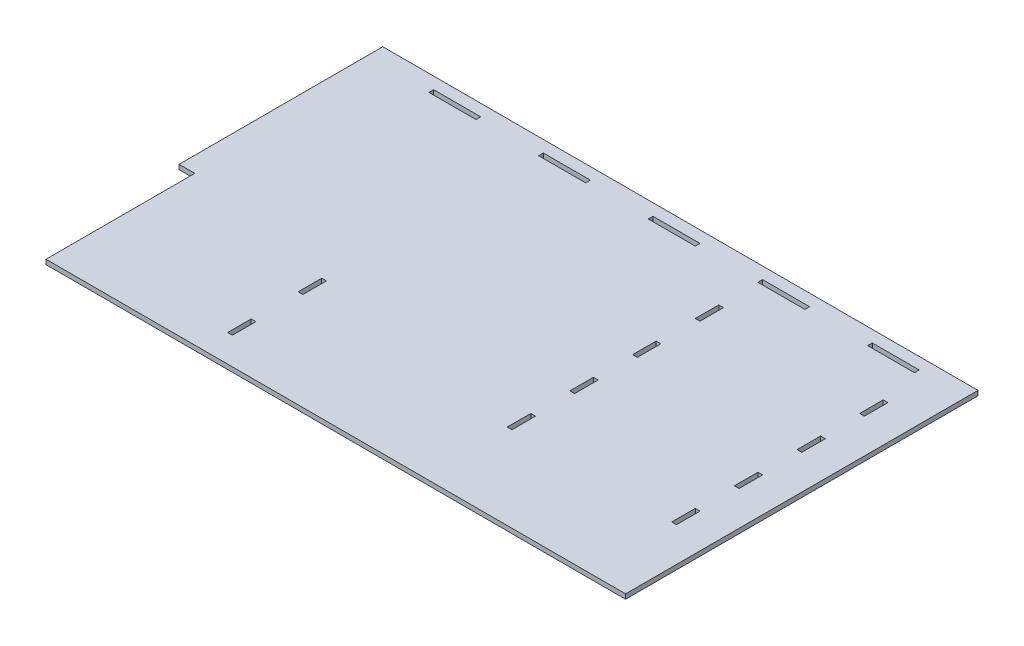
ISO-10303-21;
HEADER;
FILE_DESCRIPTION(('STEP AP214'),'2;1');
FILE_NAME('part.step','',(''),(''),'','','');
FILE_SCHEMA(('AUTOMOTIVE_DESIGN { 1 0 10303 214 1 1 1 1 }'));
ENDSEC;
DATA;
#1=APPLICATION_CONTEXT('core data for automotive mechanical design processes');
#2=APPLICATION_PROTOCOL_DEFINITION('international standard','automotive_design',2000,#1);
#3=PRODUCT_CONTEXT('',#1,'mechanical');
#4=PRODUCT('Part','Part','',(#3));
#5=PRODUCT_RELATED_PRODUCT_CATEGORY('part','',(#4));
#6=PRODUCT_DEFINITION_FORMATION('','',#4);
#7=PRODUCT_DEFINITION_CONTEXT('part definition',#1,'design');
#8=PRODUCT_DEFINITION('design','',#6,#7);
#9=PRODUCT_DEFINITION_SHAPE('','',#8);
#10=(LENGTH_UNIT() NAMED_UNIT(*) SI_UNIT(.MILLI.,.METRE.));
#11=(NAMED_UNIT(*) PLANE_ANGLE_UNIT() SI_UNIT($,.RADIAN.));
#12=(NAMED_UNIT(*) SI_UNIT($,.STERADIAN.) SOLID_ANGLE_UNIT());
#13=UNCERTAINTY_MEASURE_WITH_UNIT(LENGTH_MEASURE(1.E-05),#10,'distance_accuracy_value','');
#14=(GEOMETRIC_REPRESENTATION_CONTEXT(3) GLOBAL_UNCERTAINTY_ASSIGNED_CONTEXT((#13)) GLOBAL_UNIT_ASSIGNED_CONTEXT((#10,
#11,#12)) REPRESENTATION_CONTEXT('',''));
#15=CARTESIAN_POINT('',(0.,0.,0.));
#16=DIRECTION('',(0.,0.,1.));
#17=DIRECTION('',(1.,0.,0.));
#18=AXIS2_PLACEMENT_3D('',#15,#16,#17);
#19=CARTESIAN_POINT('',(390.,3.,0.));
#20=DIRECTION('',(0.,0.,-1.));
#21=DIRECTION('',(-1.,0.,0.));
#22=AXIS2_PLACEMENT_3D('',#19,#20,#21);
#23=PLANE('',#22);
#24=DIRECTION('',(1.,0.,0.));
#25=VECTOR('',#24,1.);
#26=CARTESIAN_POINT('',(390.,3.,0.));
#27=LINE('',#26,#25);
#28=CARTESIAN_POINT('',(10.,3.,0.));
#29=VERTEX_POINT('',#28);
#30=CARTESIAN_POINT('',(380.,3.,0.));
#31=VERTEX_POINT('',#30);
#32=EDGE_CURVE('E861',#29,#31,#27,.T.);
#33=ORIENTED_EDGE('',*,*,#32,.F.);
#34=DIRECTION('',(0.,1.,0.));
#35=VECTOR('',#34,1.);
#36=CARTESIAN_POINT('',(10.,0.,0.));
#37=LINE('',#36,#35);
#38=CARTESIAN_POINT('',(10.,0.,0.));
#39=VERTEX_POINT('',#38);
#40=EDGE_CURVE('E682',#39,#29,#37,.T.);
#41=ORIENTED_EDGE('',*,*,#40,.F.);
#42=DIRECTION('',(1.,0.,0.));
#43=VECTOR('',#42,1.);
#44=CARTESIAN_POINT('',(390.,0.,0.));
#45=LINE('',#44,#43);
#46=CARTESIAN_POINT('',(380.,0.,0.));
#47=VERTEX_POINT('',#46);
#48=EDGE_CURVE('E728',#39,#47,#45,.T.);
#49=ORIENTED_EDGE('',*,*,#48,.T.);
#50=DIRECTION('',(0.,1.,0.));
#51=VECTOR('',#50,1.);
#52=CARTESIAN_POINT('',(380.,-7.,0.));
#53=LINE('',#52,#51);
#54=EDGE_CURVE('E696',#47,#31,#53,.T.);
#55=ORIENTED_EDGE('',*,*,#54,.T.);
#56=EDGE_LOOP('',(#33,#41,#49,#55));
#57=FACE_BOUND('',#56,.T.);
#58=ADVANCED_FACE('F32',(#57),#23,.F.);
#59=CARTESIAN_POINT('',(0.,3.,-225.));
#60=DIRECTION('',(0.,0.,1.));
#61=DIRECTION('',(1.,0.,0.));
#62=AXIS2_PLACEMENT_3D('',#59,#60,#61);
#63=PLANE('',#62);
#64=DIRECTION('',(-1.,0.,0.));
#65=VECTOR('',#64,1.);
#66=CARTESIAN_POINT('',(0.,3.,-225.));
#67=LINE('',#66,#65);
#68=CARTESIAN_POINT('',(380.,3.,-225.));
#69=VERTEX_POINT('',#68);
#70=CARTESIAN_POINT('',(0.,3.,-225.));
#71=VERTEX_POINT('',#70);
#72=EDGE_CURVE('E863',#69,#71,#67,.T.);
#73=ORIENTED_EDGE('',*,*,#72,.F.);
#74=DIRECTION('',(0.,1.,0.));
#75=VECTOR('',#74,1.);
#76=CARTESIAN_POINT('',(380.,-7.,-225.));
#77=LINE('',#76,#75);
#78=CARTESIAN_POINT('',(380.,0.,-225.));
#79=VERTEX_POINT('',#78);
#80=EDGE_CURVE('E695',#79,#69,#77,.T.);
#81=ORIENTED_EDGE('',*,*,#80,.F.);
#82=DIRECTION('',(-1.,0.,0.));
#83=VECTOR('',#82,1.);
#84=CARTESIAN_POINT('',(0.,0.,-225.));
#85=LINE('',#84,#83);
#86=CARTESIAN_POINT('',(0.,0.,-225.));
#87=VERTEX_POINT('',#86);
#88=EDGE_CURVE('E871',#79,#87,#85,.T.);
#89=ORIENTED_EDGE('',*,*,#88,.T.);
#90=DIRECTION('',(0.,-1.,0.));
#91=VECTOR('',#90,1.);
#92=CARTESIAN_POINT('',(0.,3.,-225.));
#93=LINE('',#92,#91);
#94=EDGE_CURVE('E869',#71,#87,#93,.T.);
#95=ORIENTED_EDGE('',*,*,#94,.F.);
#96=EDGE_LOOP('',(#73,#81,#89,#95));
#97=FACE_BOUND('',#96,.T.);
#98=ADVANCED_FACE('F1048',(#97),#63,.F.);
#99=CARTESIAN_POINT('',(0.,3.,0.));
#100=DIRECTION('',(1.,0.,0.));
#101=DIRECTION('',(0.,0.,-1.));
#102=AXIS2_PLACEMENT_3D('',#99,#100,#101);
#103=PLANE('',#102);
#104=DIRECTION('',(0.,0.,1.));
#105=VECTOR('',#104,1.);
#106=CARTESIAN_POINT('',(0.,0.,0.));
#107=LINE('',#106,#105);
#108=CARTESIAN_POINT('',(0.,0.,-95.));
#109=VERTEX_POINT('',#108);
#110=EDGE_CURVE('E864',#87,#109,#107,.T.);
#111=ORIENTED_EDGE('',*,*,#110,.T.);
#112=DIRECTION('',(0.,1.,0.));
#113=VECTOR('',#112,1.);
#114=CARTESIAN_POINT('',(0.,0.,-95.));
#115=LINE('',#114,#113);
#116=CARTESIAN_POINT('',(0.,3.,-95.));
#117=VERTEX_POINT('',#116);
#118=EDGE_CURVE('E686',#109,#117,#115,.T.);
#119=ORIENTED_EDGE('',*,*,#118,.T.);
#120=DIRECTION('',(0.,0.,1.));
#121=VECTOR('',#120,1.);
#122=CARTESIAN_POINT('',(0.,3.,0.));
#123=LINE('',#122,#121);
#124=EDGE_CURVE('E866',#71,#117,#123,.T.);
#125=ORIENTED_EDGE('',*,*,#124,.F.);
#126=ORIENTED_EDGE('',*,*,#94,.T.);
#127=EDGE_LOOP('',(#111,#119,#125,#126));
#128=FACE_BOUND('',#127,.T.);
#129=ADVANCED_FACE('F971',(#128),#103,.F.);
#130=CARTESIAN_POINT('',(0.,3.,0.));
#131=DIRECTION('',(0.,-1.,0.));
#132=DIRECTION('',(0.,0.,-1.));
#133=AXIS2_PLACEMENT_3D('',#130,#131,#132);
#134=PLANE('',#133);
#135=DIRECTION('',(1.,0.,0.));
#136=VECTOR('',#135,1.);
#137=CARTESIAN_POINT('',(110.,3.,-62.5));
#138=LINE('',#137,#136);
#139=CARTESIAN_POINT('',(108.5,3.,-62.5));
#140=VERTEX_POINT('',#139);
#141=CARTESIAN_POINT('',(111.5,3.,-62.5));
#142=VERTEX_POINT('',#141);
#143=EDGE_CURVE('E474',#140,#142,#138,.T.);
#144=ORIENTED_EDGE('',*,*,#143,.F.);
#145=DIRECTION('',(0.,0.,1.));
#146=VECTOR('',#145,1.);
#147=CARTESIAN_POINT('',(108.5,3.,-77.5));
#148=LINE('',#147,#146);
#149=CARTESIAN_POINT('',(108.5,3.,-77.5));
#150=VERTEX_POINT('',#149);
#151=EDGE_CURVE('E46',#150,#140,#148,.T.);
#152=ORIENTED_EDGE('',*,*,#151,.F.);
#153=DIRECTION('',(-1.,0.,0.));
#154=VECTOR('',#153,1.);
#155=CARTESIAN_POINT('',(111.5,3.,-77.5));
#156=LINE('',#155,#154);
#157=CARTESIAN_POINT('',(111.5,3.,-77.5));
#158=VERTEX_POINT('',#157);
#159=EDGE_CURVE('E479',#158,#150,#156,.T.);
#160=ORIENTED_EDGE('',*,*,#159,.F.);
#161=DIRECTION('',(0.,0.,-1.));
#162=VECTOR('',#161,1.);
#163=CARTESIAN_POINT('',(111.5,3.,-62.5));
#164=LINE('',#163,#162);
#165=EDGE_CURVE('E450',#142,#158,#164,.T.);
#166=ORIENTED_EDGE('',*,*,#165,.F.);
#167=EDGE_LOOP('',(#144,#152,#160,#166));
#168=FACE_BOUND('',#167,.T.);
#169=DIRECTION('',(0.,0.,1.));
#170=VECTOR('',#169,1.);
#171=CARTESIAN_POINT('',(108.5,3.,-17.5));
#172=LINE('',#171,#170);
#173=CARTESIAN_POINT('',(108.5,3.,-32.5));
#174=VERTEX_POINT('',#173);
#175=CARTESIAN_POINT('',(108.5,3.,-17.5));
#176=VERTEX_POINT('',#175);
#177=EDGE_CURVE('E500',#174,#176,#172,.T.);
#178=ORIENTED_EDGE('',*,*,#177,.F.);
#179=DIRECTION('',(-1.,0.,0.));
#180=VECTOR('',#179,1.);
#181=CARTESIAN_POINT('',(110.,3.,-32.5));
#182=LINE('',#181,#180);
#183=CARTESIAN_POINT('',(111.5,3.,-32.5));
#184=VERTEX_POINT('',#183);
#185=EDGE_CURVE('E491',#184,#174,#182,.T.);
#186=ORIENTED_EDGE('',*,*,#185,.F.);
#187=DIRECTION('',(0.,0.,-1.));
#188=VECTOR('',#187,1.);
#189=CARTESIAN_POINT('',(111.5,3.,-32.5));
#190=LINE('',#189,#188);
#191=CARTESIAN_POINT('',(111.5,3.,-17.5));
#192=VERTEX_POINT('',#191);
#193=EDGE_CURVE('E505',#192,#184,#190,.T.);
#194=ORIENTED_EDGE('',*,*,#193,.F.);
#195=DIRECTION('',(1.,0.,0.));
#196=VECTOR('',#195,1.);
#197=CARTESIAN_POINT('',(111.5,3.,-17.5));
#198=LINE('',#197,#196);
#199=EDGE_CURVE('E502',#176,#192,#198,.T.);
#200=ORIENTED_EDGE('',*,*,#199,.F.);
#201=EDGE_LOOP('',(#178,#186,#194,#200));
#202=FACE_BOUND('',#201,.T.);
#203=DIRECTION('',(1.,0.,0.));
#204=VECTOR('',#203,1.);
#205=CARTESIAN_POINT('',(253.,3.,-134.5));
#206=LINE('',#205,#204);
#207=CARTESIAN_POINT('',(250.,3.,-134.5));
#208=VERTEX_POINT('',#207);
#209=CARTESIAN_POINT('',(253.,3.,-134.5));
#210=VERTEX_POINT('',#209);
#211=EDGE_CURVE('E577',#208,#210,#206,.T.);
#212=ORIENTED_EDGE('',*,*,#211,.F.);
#213=DIRECTION('',(0.,0.,1.));
#214=VECTOR('',#213,1.);
#215=CARTESIAN_POINT('',(250.,3.,-134.5));
#216=LINE('',#215,#214);
#217=CARTESIAN_POINT('',(250.,3.,-149.5));
#218=VERTEX_POINT('',#217);
#219=EDGE_CURVE('E575',#218,#208,#216,.T.);
#220=ORIENTED_EDGE('',*,*,#219,.F.);
#221=DIRECTION('',(-1.,0.,0.));
#222=VECTOR('',#221,1.);
#223=CARTESIAN_POINT('',(250.,3.,-149.5));
#224=LINE('',#223,#222);
#225=CARTESIAN_POINT('',(253.,3.,-149.5));
#226=VERTEX_POINT('',#225);
#227=EDGE_CURVE('E584',#226,#218,#224,.T.);
#228=ORIENTED_EDGE('',*,*,#227,.F.);
#229=DIRECTION('',(0.,0.,-1.));
#230=VECTOR('',#229,1.);
#231=CARTESIAN_POINT('',(253.,3.,-149.5));
#232=LINE('',#231,#230);
#233=EDGE_CURVE('E581',#210,#226,#232,.T.);
#234=ORIENTED_EDGE('',*,*,#233,.F.);
#235=EDGE_LOOP('',(#212,#220,#228,#234));
#236=FACE_BOUND('',#235,.T.);
#237=DIRECTION('',(1.,0.,0.));
#238=VECTOR('',#237,1.);
#239=CARTESIAN_POINT('',(253.,3.,-94.5000000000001));
#240=LINE('',#239,#238);
#241=CARTESIAN_POINT('',(250.,3.,-94.5000000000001));
#242=VERTEX_POINT('',#241);
#243=CARTESIAN_POINT('',(253.,3.,-94.5000000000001));
#244=VERTEX_POINT('',#243);
#245=EDGE_CURVE('E599',#242,#244,#240,.T.);
#246=ORIENTED_EDGE('',*,*,#245,.F.);
#247=DIRECTION('',(0.,0.,1.));
#248=VECTOR('',#247,1.);
#249=CARTESIAN_POINT('',(250.,3.,-94.5000000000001));
#250=LINE('',#249,#248);
#251=CARTESIAN_POINT('',(250.,3.,-109.5));
#252=VERTEX_POINT('',#251);
#253=EDGE_CURVE('E597',#252,#242,#250,.T.);
#254=ORIENTED_EDGE('',*,*,#253,.F.);
#255=DIRECTION('',(-1.,0.,0.));
#256=VECTOR('',#255,1.);
#257=CARTESIAN_POINT('',(250.,3.,-109.5));
#258=LINE('',#257,#256);
#259=CARTESIAN_POINT('',(253.,3.,-109.5));
#260=VERTEX_POINT('',#259);
#261=EDGE_CURVE('E606',#260,#252,#258,.T.);
#262=ORIENTED_EDGE('',*,*,#261,.F.);
#263=DIRECTION('',(0.,0.,-1.));
#264=VECTOR('',#263,1.);
#265=CARTESIAN_POINT('',(253.,3.,-109.5));
#266=LINE('',#265,#264);
#267=EDGE_CURVE('E603',#244,#260,#266,.T.);
#268=ORIENTED_EDGE('',*,*,#267,.F.);
#269=EDGE_LOOP('',(#246,#254,#262,#268));
#270=FACE_BOUND('',#269,.T.);
#271=DIRECTION('',(1.,0.,0.));
#272=VECTOR('',#271,1.);
#273=CARTESIAN_POINT('',(253.,3.,-54.5000000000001));
#274=LINE('',#273,#272);
#275=CARTESIAN_POINT('',(250.,3.,-54.5000000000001));
#276=VERTEX_POINT('',#275);
#277=CARTESIAN_POINT('',(253.,3.,-54.5000000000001));
#278=VERTEX_POINT('',#277);
#279=EDGE_CURVE('E619',#276,#278,#274,.T.);
#280=ORIENTED_EDGE('',*,*,#279,.F.);
#281=DIRECTION('',(0.,0.,1.));
#282=VECTOR('',#281,1.);
#283=CARTESIAN_POINT('',(250.,3.,-54.5000000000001));
#284=LINE('',#283,#282);
#285=CARTESIAN_POINT('',(250.,3.,-69.5000000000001));
#286=VERTEX_POINT('',#285);
#287=EDGE_CURVE('E617',#286,#276,#284,.T.);
#288=ORIENTED_EDGE('',*,*,#287,.F.);
#289=DIRECTION('',(-1.,0.,0.));
#290=VECTOR('',#289,1.);
#291=CARTESIAN_POINT('',(250.,3.,-69.5000000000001));
#292=LINE('',#291,#290);
#293=CARTESIAN_POINT('',(253.,3.,-69.5000000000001));
#294=VERTEX_POINT('',#293);
#295=EDGE_CURVE('E626',#294,#286,#292,.T.);
#296=ORIENTED_EDGE('',*,*,#295,.F.);
#297=DIRECTION('',(0.,0.,-1.));
#298=VECTOR('',#297,1.);
#299=CARTESIAN_POINT('',(253.,3.,-69.5000000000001));
#300=LINE('',#299,#298);
#301=EDGE_CURVE('E623',#278,#294,#300,.T.);
#302=ORIENTED_EDGE('',*,*,#301,.F.);
#303=EDGE_LOOP('',(#280,#288,#296,#302));
#304=FACE_BOUND('',#303,.T.);
#305=DIRECTION('',(0.,0.,1.));
#306=VECTOR('',#305,1.);
#307=CARTESIAN_POINT('',(355.,3.,-69.5000000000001));
#308=LINE('',#307,#306);
#309=CARTESIAN_POINT('',(355.,3.,-69.5000000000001));
#310=VERTEX_POINT('',#309);
#311=CARTESIAN_POINT('',(355.,3.,-54.5000000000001));
#312=VERTEX_POINT('',#311);
#313=EDGE_CURVE('E638',#310,#312,#308,.T.);
#314=ORIENTED_EDGE('',*,*,#313,.F.);
#315=DIRECTION('',(-1.,0.,0.));
#316=VECTOR('',#315,1.);
#317=CARTESIAN_POINT('',(358.,3.,-69.5000000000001));
#318=LINE('',#317,#316);
#319=CARTESIAN_POINT('',(358.,3.,-69.5000000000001));
#320=VERTEX_POINT('',#319);
#321=EDGE_CURVE('E530',#320,#310,#318,.T.);
#322=ORIENTED_EDGE('',*,*,#321,.F.);
#323=DIRECTION('',(0.,0.,-1.));
#324=VECTOR('',#323,1.);
#325=CARTESIAN_POINT('',(358.,3.,-54.5000000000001));
#326=LINE('',#325,#324);
#327=CARTESIAN_POINT('',(358.,3.,-54.5000000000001));
#328=VERTEX_POINT('',#327);
#329=EDGE_CURVE('E644',#328,#320,#326,.T.);
#330=ORIENTED_EDGE('',*,*,#329,.F.);
#331=DIRECTION('',(1.,0.,0.));
#332=VECTOR('',#331,1.);
#333=CARTESIAN_POINT('',(355.,3.,-54.5000000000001));
#334=LINE('',#333,#332);
#335=EDGE_CURVE('E641',#312,#328,#334,.T.);
#336=ORIENTED_EDGE('',*,*,#335,.F.);
#337=EDGE_LOOP('',(#314,#322,#330,#336));
#338=FACE_BOUND('',#337,.T.);
#339=DIRECTION('',(0.,0.,-1.));
#340=VECTOR('',#339,1.);
#341=CARTESIAN_POINT('',(358.,3.,-94.5000000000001));
#342=LINE('',#341,#340);
#343=CARTESIAN_POINT('',(358.,3.,-94.5000000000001));
#344=VERTEX_POINT('',#343);
#345=CARTESIAN_POINT('',(358.,3.,-109.5));
#346=VERTEX_POINT('',#345);
#347=EDGE_CURVE('E517',#344,#346,#342,.T.);
#348=ORIENTED_EDGE('',*,*,#347,.F.);
#349=DIRECTION('',(1.,0.,0.));
#350=VECTOR('',#349,1.);
#351=CARTESIAN_POINT('',(355.,3.,-94.5000000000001));
#352=LINE('',#351,#350);
#353=CARTESIAN_POINT('',(355.,3.,-94.5000000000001));
#354=VERTEX_POINT('',#353);
#355=EDGE_CURVE('E515',#354,#344,#352,.T.);
#356=ORIENTED_EDGE('',*,*,#355,.F.);
#357=DIRECTION('',(0.,0.,1.));
#358=VECTOR('',#357,1.);
#359=CARTESIAN_POINT('',(355.,3.,-109.5));
#360=LINE('',#359,#358);
#361=CARTESIAN_POINT('',(355.,3.,-109.5));
#362=VERTEX_POINT('',#361);
#363=EDGE_CURVE('E524',#362,#354,#360,.T.);
#364=ORIENTED_EDGE('',*,*,#363,.F.);
#365=DIRECTION('',(-1.,0.,0.));
#366=VECTOR('',#365,1.);
#367=CARTESIAN_POINT('',(358.,3.,-109.5));
#368=LINE('',#367,#366);
#369=EDGE_CURVE('E521',#346,#362,#368,.T.);
#370=ORIENTED_EDGE('',*,*,#369,.F.);
#371=EDGE_LOOP('',(#348,#356,#364,#370));
#372=FACE_BOUND('',#371,.T.);
#373=DIRECTION('',(0.,0.,-1.));
#374=VECTOR('',#373,1.);
#375=CARTESIAN_POINT('',(358.,3.,-134.5));
#376=LINE('',#375,#374);
#377=CARTESIAN_POINT('',(358.,3.,-134.5));
#378=VERTEX_POINT('',#377);
#379=CARTESIAN_POINT('',(358.,3.,-149.5));
#380=VERTEX_POINT('',#379);
#381=EDGE_CURVE('E539',#378,#380,#376,.T.);
#382=ORIENTED_EDGE('',*,*,#381,.F.);
#383=DIRECTION('',(1.,0.,0.));
#384=VECTOR('',#383,1.);
#385=CARTESIAN_POINT('',(355.,3.,-134.5));
#386=LINE('',#385,#384);
#387=CARTESIAN_POINT('',(355.,3.,-134.5));
#388=VERTEX_POINT('',#387);
#389=EDGE_CURVE('E537',#388,#378,#386,.T.);
#390=ORIENTED_EDGE('',*,*,#389,.F.);
#391=DIRECTION('',(0.,0.,1.));
#392=VECTOR('',#391,1.);
#393=CARTESIAN_POINT('',(355.,3.,-149.5));
#394=LINE('',#393,#392);
#395=CARTESIAN_POINT('',(355.,3.,-149.5));
#396=VERTEX_POINT('',#395);
#397=EDGE_CURVE('E546',#396,#388,#394,.T.);
#398=ORIENTED_EDGE('',*,*,#397,.F.);
#399=DIRECTION('',(-1.,0.,0.));
#400=VECTOR('',#399,1.);
#401=CARTESIAN_POINT('',(358.,3.,-149.5));
#402=LINE('',#401,#400);
#403=EDGE_CURVE('E543',#380,#396,#402,.T.);
#404=ORIENTED_EDGE('',*,*,#403,.F.);
#405=EDGE_LOOP('',(#382,#390,#398,#404));
#406=FACE_BOUND('',#405,.T.);
#407=DIRECTION('',(-1.,0.,0.));
#408=VECTOR('',#407,1.);
#409=CARTESIAN_POINT('',(355.,3.,-189.5));
#410=LINE('',#409,#408);
#411=CARTESIAN_POINT('',(358.,3.,-189.5));
#412=VERTEX_POINT('',#411);
#413=CARTESIAN_POINT('',(355.,3.,-189.5));
#414=VERTEX_POINT('',#413);
#415=EDGE_CURVE('E558',#412,#414,#410,.T.);
#416=ORIENTED_EDGE('',*,*,#415,.F.);
#417=DIRECTION('',(0.,0.,-1.));
#418=VECTOR('',#417,1.);
#419=CARTESIAN_POINT('',(358.,3.,-189.5));
#420=LINE('',#419,#418);
#421=CARTESIAN_POINT('',(358.,3.,-174.5));
#422=VERTEX_POINT('',#421);
#423=EDGE_CURVE('E484',#422,#412,#420,.T.);
#424=ORIENTED_EDGE('',*,*,#423,.F.);
#425=DIRECTION('',(1.,0.,0.));
#426=VECTOR('',#425,1.);
#427=CARTESIAN_POINT('',(358.,3.,-174.5));
#428=LINE('',#427,#426);
#429=CARTESIAN_POINT('',(355.,3.,-174.5));
#430=VERTEX_POINT('',#429);
#431=EDGE_CURVE('E564',#430,#422,#428,.T.);
#432=ORIENTED_EDGE('',*,*,#431,.F.);
#433=DIRECTION('',(0.,0.,1.));
#434=VECTOR('',#433,1.);
#435=CARTESIAN_POINT('',(355.,3.,-174.5));
#436=LINE('',#435,#434);
#437=EDGE_CURVE('E561',#414,#430,#436,.T.);
#438=ORIENTED_EDGE('',*,*,#437,.F.);
#439=EDGE_LOOP('',(#416,#424,#432,#438));
#440=FACE_BOUND('',#439,.T.);
#441=DIRECTION('',(0.,0.,1.));
#442=VECTOR('',#441,1.);
#443=CARTESIAN_POINT('',(250.,3.,-189.5));
#444=LINE('',#443,#442);
#445=CARTESIAN_POINT('',(250.,3.,-189.5));
#446=VERTEX_POINT('',#445);
#447=CARTESIAN_POINT('',(250.,3.,-174.5));
#448=VERTEX_POINT('',#447);
#449=EDGE_CURVE('E656',#446,#448,#444,.T.);
#450=ORIENTED_EDGE('',*,*,#449,.F.);
#451=DIRECTION('',(-1.,0.,0.));
#452=VECTOR('',#451,1.);
#453=CARTESIAN_POINT('',(253.,3.,-189.5));
#454=LINE('',#453,#452);
#455=CARTESIAN_POINT('',(253.,3.,-189.5));
#456=VERTEX_POINT('',#455);
#457=EDGE_CURVE('E590',#456,#446,#454,.T.);
#458=ORIENTED_EDGE('',*,*,#457,.F.);
#459=DIRECTION('',(0.,0.,-1.));
#460=VECTOR('',#459,1.);
#461=CARTESIAN_POINT('',(253.,3.,-174.5));
#462=LINE('',#461,#460);
#463=CARTESIAN_POINT('',(253.,3.,-174.5));
#464=VERTEX_POINT('',#463);
#465=EDGE_CURVE('E662',#464,#456,#462,.T.);
#466=ORIENTED_EDGE('',*,*,#465,.F.);
#467=DIRECTION('',(1.,0.,0.));
#468=VECTOR('',#467,1.);
#469=CARTESIAN_POINT('',(250.,3.,-174.5));
#470=LINE('',#469,#468);
#471=EDGE_CURVE('E659',#448,#464,#470,.T.);
#472=ORIENTED_EDGE('',*,*,#471,.F.);
#473=EDGE_LOOP('',(#450,#458,#466,#472));
#474=FACE_BOUND('',#473,.T.);
#475=DIRECTION('',(1.,0.,0.));
#476=VECTOR('',#475,1.);
#477=CARTESIAN_POINT('',(70.,3.,-214.5));
#478=LINE('',#477,#476);
#479=CARTESIAN_POINT('',(40.,3.,-214.5));
#480=VERTEX_POINT('',#479);
#481=CARTESIAN_POINT('',(70.,3.,-214.5));
#482=VERTEX_POINT('',#481);
#483=EDGE_CURVE('E717',#480,#482,#478,.T.);
#484=ORIENTED_EDGE('',*,*,#483,.F.);
#485=DIRECTION('',(0.,0.,1.));
#486=VECTOR('',#485,1.);
#487=CARTESIAN_POINT('',(40.,3.,-214.5));
#488=LINE('',#487,#486);
#489=CARTESIAN_POINT('',(40.,3.,-217.5));
#490=VERTEX_POINT('',#489);
#491=EDGE_CURVE('E715',#490,#480,#488,.T.);
#492=ORIENTED_EDGE('',*,*,#491,.F.);
#493=DIRECTION('',(-1.,0.,0.));
#494=VECTOR('',#493,1.);
#495=CARTESIAN_POINT('',(40.,3.,-217.5));
#496=LINE('',#495,#494);
#497=CARTESIAN_POINT('',(70.,3.,-217.5));
#498=VERTEX_POINT('',#497);
#499=EDGE_CURVE('E705',#498,#490,#496,.T.);
#500=ORIENTED_EDGE('',*,*,#499,.F.);
#501=DIRECTION('',(0.,0.,-1.));
#502=VECTOR('',#501,1.);
#503=CARTESIAN_POINT('',(70.,3.,-217.5));
#504=LINE('',#503,#502);
#505=EDGE_CURVE('E721',#482,#498,#504,.T.);
#506=ORIENTED_EDGE('',*,*,#505,.F.);
#507=EDGE_LOOP('',(#484,#492,#500,#506));
#508=FACE_BOUND('',#507,.T.);
#509=DIRECTION('',(-1.,0.,0.));
#510=VECTOR('',#509,1.);
#511=CARTESIAN_POINT('',(180.,3.,-217.5));
#512=LINE('',#511,#510);
#513=CARTESIAN_POINT('',(210.,3.,-217.5));
#514=VERTEX_POINT('',#513);
#515=CARTESIAN_POINT('',(180.,3.,-217.5));
#516=VERTEX_POINT('',#515);
#517=EDGE_CURVE('E751',#514,#516,#512,.T.);
#518=ORIENTED_EDGE('',*,*,#517,.F.);
#519=DIRECTION('',(0.,0.,-1.));
#520=VECTOR('',#519,1.);
#521=CARTESIAN_POINT('',(210.,3.,-217.5));
#522=LINE('',#521,#520);
#523=CARTESIAN_POINT('',(210.,3.,-214.5));
#524=VERTEX_POINT('',#523);
#525=EDGE_CURVE('E749',#524,#514,#522,.T.);
#526=ORIENTED_EDGE('',*,*,#525,.F.);
#527=DIRECTION('',(1.,0.,0.));
#528=VECTOR('',#527,1.);
#529=CARTESIAN_POINT('',(210.,3.,-214.5));
#530=LINE('',#529,#528);
#531=CARTESIAN_POINT('',(180.,3.,-214.5));
#532=VERTEX_POINT('',#531);
#533=EDGE_CURVE('E739',#532,#524,#530,.T.);
#534=ORIENTED_EDGE('',*,*,#533,.F.);
#535=DIRECTION('',(0.,0.,1.));
#536=VECTOR('',#535,1.);
#537=CARTESIAN_POINT('',(180.,3.,-214.5));
#538=LINE('',#537,#536);
#539=EDGE_CURVE('E755',#516,#532,#538,.T.);
#540=ORIENTED_EDGE('',*,*,#539,.F.);
#541=EDGE_LOOP('',(#518,#526,#534,#540));
#542=FACE_BOUND('',#541,.T.);
#543=DIRECTION('',(1.,0.,0.));
#544=VECTOR('',#543,1.);
#545=CARTESIAN_POINT('',(110.,3.,-214.5));
#546=LINE('',#545,#544);
#547=CARTESIAN_POINT('',(110.,3.,-214.5));
#548=VERTEX_POINT('',#547);
#549=CARTESIAN_POINT('',(140.,3.,-214.5));
#550=VERTEX_POINT('',#549);
#551=EDGE_CURVE('E783',#548,#550,#546,.T.);
#552=ORIENTED_EDGE('',*,*,#551,.F.);
#553=DIRECTION('',(0.,0.,1.));
#554=VECTOR('',#553,1.);
#555=CARTESIAN_POINT('',(110.,3.,-217.5));
#556=LINE('',#555,#554);
#557=CARTESIAN_POINT('',(110.,3.,-217.5));
#558=VERTEX_POINT('',#557);
#559=EDGE_CURVE('E781',#558,#548,#556,.T.);
#560=ORIENTED_EDGE('',*,*,#559,.F.);
#561=DIRECTION('',(-1.,0.,0.));
#562=VECTOR('',#561,1.);
#563=CARTESIAN_POINT('',(140.,3.,-217.5));
#564=LINE('',#563,#562);
#565=CARTESIAN_POINT('',(140.,3.,-217.5));
#566=VERTEX_POINT('',#565);
#567=EDGE_CURVE('E771',#566,#558,#564,.T.);
#568=ORIENTED_EDGE('',*,*,#567,.F.);
#569=DIRECTION('',(0.,0.,-1.));
#570=VECTOR('',#569,1.);
#571=CARTESIAN_POINT('',(140.,3.,-214.5));
#572=LINE('',#571,#570);
#573=EDGE_CURVE('E787',#550,#566,#572,.T.);
#574=ORIENTED_EDGE('',*,*,#573,.F.);
#575=EDGE_LOOP('',(#552,#560,#568,#574));
#576=FACE_BOUND('',#575,.T.);
#577=DIRECTION('',(-1.,0.,0.));
#578=VECTOR('',#577,1.);
#579=CARTESIAN_POINT('',(320.,3.,-217.5));
#580=LINE('',#579,#578);
#581=CARTESIAN_POINT('',(350.,3.,-217.5));
#582=VERTEX_POINT('',#581);
#583=CARTESIAN_POINT('',(320.,3.,-217.5));
#584=VERTEX_POINT('',#583);
#585=EDGE_CURVE('E815',#582,#584,#580,.T.);
#586=ORIENTED_EDGE('',*,*,#585,.F.);
#587=DIRECTION('',(0.,0.,-1.));
#588=VECTOR('',#587,1.);
#589=CARTESIAN_POINT('',(350.,3.,-217.5));
#590=LINE('',#589,#588);
#591=CARTESIAN_POINT('',(350.,3.,-214.5));
#592=VERTEX_POINT('',#591);
#593=EDGE_CURVE('E813',#592,#582,#590,.T.);
#594=ORIENTED_EDGE('',*,*,#593,.F.);
#595=DIRECTION('',(1.,0.,0.));
#596=VECTOR('',#595,1.);
#597=CARTESIAN_POINT('',(350.,3.,-214.5));
#598=LINE('',#597,#596);
#599=CARTESIAN_POINT('',(320.,3.,-214.5));
#600=VERTEX_POINT('',#599);
#601=EDGE_CURVE('E803',#600,#592,#598,.T.);
#602=ORIENTED_EDGE('',*,*,#601,.F.);
#603=DIRECTION('',(0.,0.,1.));
#604=VECTOR('',#603,1.);
#605=CARTESIAN_POINT('',(320.,3.,-214.5));
#606=LINE('',#605,#604);
#607=EDGE_CURVE('E819',#584,#600,#606,.T.);
#608=ORIENTED_EDGE('',*,*,#607,.F.);
#609=EDGE_LOOP('',(#586,#594,#602,#608));
#610=FACE_BOUND('',#609,.T.);
#611=DIRECTION('',(1.,0.,0.));
#612=VECTOR('',#611,1.);
#613=CARTESIAN_POINT('',(250.,3.,-214.5));
#614=LINE('',#613,#612);
#615=CARTESIAN_POINT('',(250.,3.,-214.5));
#616=VERTEX_POINT('',#615);
#617=CARTESIAN_POINT('',(280.,3.,-214.5));
#618=VERTEX_POINT('',#617);
#619=EDGE_CURVE('E846',#616,#618,#614,.T.);
#620=ORIENTED_EDGE('',*,*,#619,.F.);
#621=DIRECTION('',(0.,0.,1.));
#622=VECTOR('',#621,1.);
#623=CARTESIAN_POINT('',(250.,3.,-217.5));
#624=LINE('',#623,#622);
#625=CARTESIAN_POINT('',(250.,3.,-217.5));
#626=VERTEX_POINT('',#625);
#627=EDGE_CURVE('E699',#626,#616,#624,.T.);
#628=ORIENTED_EDGE('',*,*,#627,.F.);
#629=DIRECTION('',(-1.,0.,0.));
#630=VECTOR('',#629,1.);
#631=CARTESIAN_POINT('',(280.,3.,-217.5));
#632=LINE('',#631,#630);
#633=CARTESIAN_POINT('',(280.,3.,-217.5));
#634=VERTEX_POINT('',#633);
#635=EDGE_CURVE('E835',#634,#626,#632,.T.);
#636=ORIENTED_EDGE('',*,*,#635,.F.);
#637=DIRECTION('',(0.,0.,-1.));
#638=VECTOR('',#637,1.);
#639=CARTESIAN_POINT('',(280.,3.,-214.5));
#640=LINE('',#639,#638);
#641=EDGE_CURVE('E849',#618,#634,#640,.T.);
#642=ORIENTED_EDGE('',*,*,#641,.F.);
#643=EDGE_LOOP('',(#620,#628,#636,#642));
#644=FACE_BOUND('',#643,.T.);
#645=ORIENTED_EDGE('',*,*,#124,.T.);
#646=DIRECTION('',(-1.,0.,0.));
#647=VECTOR('',#646,1.);
#648=CARTESIAN_POINT('',(0.,3.,-95.));
#649=LINE('',#648,#647);
#650=CARTESIAN_POINT('',(10.,3.,-95.));
#651=VERTEX_POINT('',#650);
#652=EDGE_CURVE('E679',#651,#117,#649,.T.);
#653=ORIENTED_EDGE('',*,*,#652,.F.);
#654=DIRECTION('',(0.,0.,-1.));
#655=VECTOR('',#654,1.);
#656=CARTESIAN_POINT('',(10.,3.,-95.));
#657=LINE('',#656,#655);
#658=EDGE_CURVE('E668',#29,#651,#657,.T.);
#659=ORIENTED_EDGE('',*,*,#658,.F.);
#660=ORIENTED_EDGE('',*,*,#32,.T.);
#661=DIRECTION('',(0.,0.,1.));
#662=VECTOR('',#661,1.);
#663=CARTESIAN_POINT('',(380.,3.,0.));
#664=LINE('',#663,#662);
#665=EDGE_CURVE('E689',#69,#31,#664,.T.);
#666=ORIENTED_EDGE('',*,*,#665,.F.);
#667=ORIENTED_EDGE('',*,*,#72,.T.);
#668=EDGE_LOOP('',(#645,#653,#659,#660,#666,#667));
#669=FACE_BOUND('',#668,.T.);
#670=ADVANCED_FACE('F968',(#168,#202,#236,#270,#304,#338,#372,#406,#440,#474,#508,#542,#576,
#610,#644,#669),#134,.F.);
#671=CARTESIAN_POINT('',(0.,0.,0.));
#672=DIRECTION('',(0.,-1.,0.));
#673=DIRECTION('',(0.,0.,-1.));
#674=AXIS2_PLACEMENT_3D('',#671,#672,#673);
#675=PLANE('',#674);
#676=DIRECTION('',(0.,0.,1.));
#677=VECTOR('',#676,1.);
#678=CARTESIAN_POINT('',(108.5,0.,-77.5));
#679=LINE('',#678,#677);
#680=CARTESIAN_POINT('',(108.5,0.,-77.5));
#681=VERTEX_POINT('',#680);
#682=CARTESIAN_POINT('',(108.5,0.,-62.5));
#683=VERTEX_POINT('',#682);
#684=EDGE_CURVE('E463',#681,#683,#679,.T.);
#685=ORIENTED_EDGE('',*,*,#684,.T.);
#686=DIRECTION('',(1.,0.,0.));
#687=VECTOR('',#686,1.);
#688=CARTESIAN_POINT('',(108.5,0.,-62.5));
#689=LINE('',#688,#687);
#690=CARTESIAN_POINT('',(111.5,0.,-62.5));
#691=VERTEX_POINT('',#690);
#692=EDGE_CURVE('E469',#683,#691,#689,.T.);
#693=ORIENTED_EDGE('',*,*,#692,.T.);
#694=DIRECTION('',(0.,0.,-1.));
#695=VECTOR('',#694,1.);
#696=CARTESIAN_POINT('',(111.5,0.,-62.5));
#697=LINE('',#696,#695);
#698=CARTESIAN_POINT('',(111.5,0.,-77.5));
#699=VERTEX_POINT('',#698);
#700=EDGE_CURVE('E447',#691,#699,#697,.T.);
#701=ORIENTED_EDGE('',*,*,#700,.T.);
#702=DIRECTION('',(-1.,0.,0.));
#703=VECTOR('',#702,1.);
#704=CARTESIAN_POINT('',(111.5,0.,-77.5));
#705=LINE('',#704,#703);
#706=EDGE_CURVE('E458',#699,#681,#705,.T.);
#707=ORIENTED_EDGE('',*,*,#706,.T.);
#708=EDGE_LOOP('',(#685,#693,#701,#707));
#709=FACE_BOUND('',#708,.T.);
#710=DIRECTION('',(-1.,0.,0.));
#711=VECTOR('',#710,1.);
#712=CARTESIAN_POINT('',(108.5,0.,-32.5));
#713=LINE('',#712,#711);
#714=CARTESIAN_POINT('',(111.5,0.,-32.5));
#715=VERTEX_POINT('',#714);
#716=CARTESIAN_POINT('',(108.5,0.,-32.5));
#717=VERTEX_POINT('',#716);
#718=EDGE_CURVE('E487',#715,#717,#713,.T.);
#719=ORIENTED_EDGE('',*,*,#718,.T.);
#720=DIRECTION('',(0.,0.,1.));
#721=VECTOR('',#720,1.);
#722=CARTESIAN_POINT('',(108.5,0.,-17.5));
#723=LINE('',#722,#721);
#724=CARTESIAN_POINT('',(108.5,0.,-17.5));
#725=VERTEX_POINT('',#724);
#726=EDGE_CURVE('E490',#717,#725,#723,.T.);
#727=ORIENTED_EDGE('',*,*,#726,.T.);
#728=DIRECTION('',(1.,0.,0.));
#729=VECTOR('',#728,1.);
#730=CARTESIAN_POINT('',(111.5,0.,-17.5));
#731=LINE('',#730,#729);
#732=CARTESIAN_POINT('',(111.5,0.,-17.5));
#733=VERTEX_POINT('',#732);
#734=EDGE_CURVE('E494',#725,#733,#731,.T.);
#735=ORIENTED_EDGE('',*,*,#734,.T.);
#736=DIRECTION('',(0.,0.,-1.));
#737=VECTOR('',#736,1.);
#738=CARTESIAN_POINT('',(111.5,0.,-32.5));
#739=LINE('',#738,#737);
#740=EDGE_CURVE('E497',#733,#715,#739,.T.);
#741=ORIENTED_EDGE('',*,*,#740,.T.);
#742=EDGE_LOOP('',(#719,#727,#735,#741));
#743=FACE_BOUND('',#742,.T.);
#744=DIRECTION('',(0.,0.,-1.));
#745=VECTOR('',#744,1.);
#746=CARTESIAN_POINT('',(250.,0.,0.));
#747=LINE('',#746,#745);
#748=CARTESIAN_POINT('',(250.,0.,-134.5));
#749=VERTEX_POINT('',#748);
#750=CARTESIAN_POINT('',(250.,0.,-149.5));
#751=VERTEX_POINT('',#750);
#752=EDGE_CURVE('E11',#749,#751,#747,.T.);
#753=ORIENTED_EDGE('',*,*,#752,.F.);
#754=DIRECTION('',(-1.,0.,0.));
#755=VECTOR('',#754,1.);
#756=CARTESIAN_POINT('',(0.,0.,-134.5));
#757=LINE('',#756,#755);
#758=CARTESIAN_POINT('',(253.,0.,-134.5));
#759=VERTEX_POINT('',#758);
#760=EDGE_CURVE('E942',#759,#749,#757,.T.);
#761=ORIENTED_EDGE('',*,*,#760,.F.);
#762=DIRECTION('',(0.,0.,1.));
#763=VECTOR('',#762,1.);
#764=CARTESIAN_POINT('',(253.,0.,0.));
#765=LINE('',#764,#763);
#766=CARTESIAN_POINT('',(253.,0.,-149.5));
#767=VERTEX_POINT('',#766);
#768=EDGE_CURVE('E944',#767,#759,#765,.T.);
#769=ORIENTED_EDGE('',*,*,#768,.F.);
#770=DIRECTION('',(1.,0.,0.));
#771=VECTOR('',#770,1.);
#772=CARTESIAN_POINT('',(0.,0.,-149.5));
#773=LINE('',#772,#771);
#774=EDGE_CURVE('E39',#751,#767,#773,.T.);
#775=ORIENTED_EDGE('',*,*,#774,.F.);
#776=EDGE_LOOP('',(#753,#761,#769,#775));
#777=FACE_BOUND('',#776,.T.);
#778=DIRECTION('',(0.,0.,-1.));
#779=VECTOR('',#778,1.);
#780=CARTESIAN_POINT('',(250.,0.,0.));
#781=LINE('',#780,#779);
#782=CARTESIAN_POINT('',(250.,0.,-94.5000000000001));
#783=VERTEX_POINT('',#782);
#784=CARTESIAN_POINT('',(250.,0.,-109.5));
#785=VERTEX_POINT('',#784);
#786=EDGE_CURVE('E940',#783,#785,#781,.T.);
#787=ORIENTED_EDGE('',*,*,#786,.F.);
#788=DIRECTION('',(-1.,0.,0.));
#789=VECTOR('',#788,1.);
#790=CARTESIAN_POINT('',(0.,0.,-94.5000000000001));
#791=LINE('',#790,#789);
#792=CARTESIAN_POINT('',(253.,0.,-94.5000000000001));
#793=VERTEX_POINT('',#792);
#794=EDGE_CURVE('E933',#793,#783,#791,.T.);
#795=ORIENTED_EDGE('',*,*,#794,.F.);
#796=DIRECTION('',(0.,0.,1.));
#797=VECTOR('',#796,1.);
#798=CARTESIAN_POINT('',(253.,0.,0.));
#799=LINE('',#798,#797);
#800=CARTESIAN_POINT('',(253.,0.,-109.5));
#801=VERTEX_POINT('',#800);
#802=EDGE_CURVE('E935',#801,#793,#799,.T.);
#803=ORIENTED_EDGE('',*,*,#802,.F.);
#804=DIRECTION('',(1.,0.,0.));
#805=VECTOR('',#804,1.);
#806=CARTESIAN_POINT('',(0.,0.,-109.5));
#807=LINE('',#806,#805);
#808=EDGE_CURVE('E938',#785,#801,#807,.T.);
#809=ORIENTED_EDGE('',*,*,#808,.F.);
#810=EDGE_LOOP('',(#787,#795,#803,#809));
#811=FACE_BOUND('',#810,.T.);
#812=DIRECTION('',(0.,0.,-1.));
#813=VECTOR('',#812,1.);
#814=CARTESIAN_POINT('',(250.,0.,0.));
#815=LINE('',#814,#813);
#816=CARTESIAN_POINT('',(250.,0.,-54.5000000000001));
#817=VERTEX_POINT('',#816);
#818=CARTESIAN_POINT('',(250.,0.,-69.5000000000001));
#819=VERTEX_POINT('',#818);
#820=EDGE_CURVE('E931',#817,#819,#815,.T.);
#821=ORIENTED_EDGE('',*,*,#820,.F.);
#822=DIRECTION('',(-1.,0.,0.));
#823=VECTOR('',#822,1.);
#824=CARTESIAN_POINT('',(0.,0.,-54.5000000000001));
#825=LINE('',#824,#823);
#826=CARTESIAN_POINT('',(253.,0.,-54.5000000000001));
#827=VERTEX_POINT('',#826);
#828=EDGE_CURVE('E924',#827,#817,#825,.T.);
#829=ORIENTED_EDGE('',*,*,#828,.F.);
#830=DIRECTION('',(0.,0.,1.));
#831=VECTOR('',#830,1.);
#832=CARTESIAN_POINT('',(253.,0.,0.));
#833=LINE('',#832,#831);
#834=CARTESIAN_POINT('',(253.,0.,-69.5000000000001));
#835=VERTEX_POINT('',#834);
#836=EDGE_CURVE('E926',#835,#827,#833,.T.);
#837=ORIENTED_EDGE('',*,*,#836,.F.);
#838=DIRECTION('',(1.,0.,0.));
#839=VECTOR('',#838,1.);
#840=CARTESIAN_POINT('',(0.,0.,-69.5000000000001));
#841=LINE('',#840,#839);
#842=EDGE_CURVE('E929',#819,#835,#841,.T.);
#843=ORIENTED_EDGE('',*,*,#842,.F.);
#844=EDGE_LOOP('',(#821,#829,#837,#843));
#845=FACE_BOUND('',#844,.T.);
#846=DIRECTION('',(1.,0.,0.));
#847=VECTOR('',#846,1.);
#848=CARTESIAN_POINT('',(0.,0.,-69.5000000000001));
#849=LINE('',#848,#847);
#850=CARTESIAN_POINT('',(355.,0.,-69.5000000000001));
#851=VERTEX_POINT('',#850);
#852=CARTESIAN_POINT('',(358.,0.,-69.5000000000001));
#853=VERTEX_POINT('',#852);
#854=EDGE_CURVE('E922',#851,#853,#849,.T.);
#855=ORIENTED_EDGE('',*,*,#854,.F.);
#856=DIRECTION('',(0.,0.,-1.));
#857=VECTOR('',#856,1.);
#858=CARTESIAN_POINT('',(355.,0.,0.));
#859=LINE('',#858,#857);
#860=CARTESIAN_POINT('',(355.,0.,-54.5000000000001));
#861=VERTEX_POINT('',#860);
#862=EDGE_CURVE('E915',#861,#851,#859,.T.);
#863=ORIENTED_EDGE('',*,*,#862,.F.);
#864=DIRECTION('',(-1.,0.,0.));
#865=VECTOR('',#864,1.);
#866=CARTESIAN_POINT('',(0.,0.,-54.5000000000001));
#867=LINE('',#866,#865);
#868=CARTESIAN_POINT('',(358.,0.,-54.5000000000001));
#869=VERTEX_POINT('',#868);
#870=EDGE_CURVE('E917',#869,#861,#867,.T.);
#871=ORIENTED_EDGE('',*,*,#870,.F.);
#872=DIRECTION('',(0.,0.,1.));
#873=VECTOR('',#872,1.);
#874=CARTESIAN_POINT('',(358.,0.,0.));
#875=LINE('',#874,#873);
#876=EDGE_CURVE('E920',#853,#869,#875,.T.);
#877=ORIENTED_EDGE('',*,*,#876,.F.);
#878=EDGE_LOOP('',(#855,#863,#871,#877));
#879=FACE_BOUND('',#878,.T.);
#880=DIRECTION('',(-1.,0.,0.));
#881=VECTOR('',#880,1.);
#882=CARTESIAN_POINT('',(0.,0.,-94.5000000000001));
#883=LINE('',#882,#881);
#884=CARTESIAN_POINT('',(358.,0.,-94.5000000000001));
#885=VERTEX_POINT('',#884);
#886=CARTESIAN_POINT('',(355.,0.,-94.5000000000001));
#887=VERTEX_POINT('',#886);
#888=EDGE_CURVE('E913',#885,#887,#883,.T.);
#889=ORIENTED_EDGE('',*,*,#888,.F.);
#890=DIRECTION('',(0.,0.,1.));
#891=VECTOR('',#890,1.);
#892=CARTESIAN_POINT('',(358.,0.,0.));
#893=LINE('',#892,#891);
#894=CARTESIAN_POINT('',(358.,0.,-109.5));
#895=VERTEX_POINT('',#894);
#896=EDGE_CURVE('E906',#895,#885,#893,.T.);
#897=ORIENTED_EDGE('',*,*,#896,.F.);
#898=DIRECTION('',(1.,0.,0.));
#899=VECTOR('',#898,1.);
#900=CARTESIAN_POINT('',(0.,0.,-109.5));
#901=LINE('',#900,#899);
#902=CARTESIAN_POINT('',(355.,0.,-109.5));
#903=VERTEX_POINT('',#902);
#904=EDGE_CURVE('E908',#903,#895,#901,.T.);
#905=ORIENTED_EDGE('',*,*,#904,.F.);
#906=DIRECTION('',(0.,0.,-1.));
#907=VECTOR('',#906,1.);
#908=CARTESIAN_POINT('',(355.,0.,0.));
#909=LINE('',#908,#907);
#910=EDGE_CURVE('E911',#887,#903,#909,.T.);
#911=ORIENTED_EDGE('',*,*,#910,.F.);
#912=EDGE_LOOP('',(#889,#897,#905,#911));
#913=FACE_BOUND('',#912,.T.);
#914=DIRECTION('',(-1.,0.,0.));
#915=VECTOR('',#914,1.);
#916=CARTESIAN_POINT('',(0.,0.,-134.5));
#917=LINE('',#916,#915);
#918=CARTESIAN_POINT('',(358.,0.,-134.5));
#919=VERTEX_POINT('',#918);
#920=CARTESIAN_POINT('',(355.,0.,-134.5));
#921=VERTEX_POINT('',#920);
#922=EDGE_CURVE('E904',#919,#921,#917,.T.);
#923=ORIENTED_EDGE('',*,*,#922,.F.);
#924=DIRECTION('',(0.,0.,1.));
#925=VECTOR('',#924,1.);
#926=CARTESIAN_POINT('',(358.,0.,0.));
#927=LINE('',#926,#925);
#928=CARTESIAN_POINT('',(358.,0.,-149.5));
#929=VERTEX_POINT('',#928);
#930=EDGE_CURVE('E897',#929,#919,#927,.T.);
#931=ORIENTED_EDGE('',*,*,#930,.F.);
#932=DIRECTION('',(1.,0.,0.));
#933=VECTOR('',#932,1.);
#934=CARTESIAN_POINT('',(0.,0.,-149.5));
#935=LINE('',#934,#933);
#936=CARTESIAN_POINT('',(355.,0.,-149.5));
#937=VERTEX_POINT('',#936);
#938=EDGE_CURVE('E899',#937,#929,#935,.T.);
#939=ORIENTED_EDGE('',*,*,#938,.F.);
#940=DIRECTION('',(0.,0.,-1.));
#941=VECTOR('',#940,1.);
#942=CARTESIAN_POINT('',(355.,0.,0.));
#943=LINE('',#942,#941);
#944=EDGE_CURVE('E902',#921,#937,#943,.T.);
#945=ORIENTED_EDGE('',*,*,#944,.F.);
#946=EDGE_LOOP('',(#923,#931,#939,#945));
#947=FACE_BOUND('',#946,.T.);
#948=DIRECTION('',(0.,0.,1.));
#949=VECTOR('',#948,1.);
#950=CARTESIAN_POINT('',(358.,0.,0.));
#951=LINE('',#950,#949);
#952=CARTESIAN_POINT('',(358.,0.,-189.5));
#953=VERTEX_POINT('',#952);
#954=CARTESIAN_POINT('',(358.,0.,-174.5));
#955=VERTEX_POINT('',#954);
#956=EDGE_CURVE('E895',#953,#955,#951,.T.);
#957=ORIENTED_EDGE('',*,*,#956,.F.);
#958=DIRECTION('',(1.,0.,0.));
#959=VECTOR('',#958,1.);
#960=CARTESIAN_POINT('',(0.,0.,-189.5));
#961=LINE('',#960,#959);
#962=CARTESIAN_POINT('',(355.,0.,-189.5));
#963=VERTEX_POINT('',#962);
#964=EDGE_CURVE('E888',#963,#953,#961,.T.);
#965=ORIENTED_EDGE('',*,*,#964,.F.);
#966=DIRECTION('',(0.,0.,-1.));
#967=VECTOR('',#966,1.);
#968=CARTESIAN_POINT('',(355.,0.,0.));
#969=LINE('',#968,#967);
#970=CARTESIAN_POINT('',(355.,0.,-174.5));
#971=VERTEX_POINT('',#970);
#972=EDGE_CURVE('E890',#971,#963,#969,.T.);
#973=ORIENTED_EDGE('',*,*,#972,.F.);
#974=DIRECTION('',(-1.,0.,0.));
#975=VECTOR('',#974,1.);
#976=CARTESIAN_POINT('',(0.,0.,-174.5));
#977=LINE('',#976,#975);
#978=EDGE_CURVE('E893',#955,#971,#977,.T.);
#979=ORIENTED_EDGE('',*,*,#978,.F.);
#980=EDGE_LOOP('',(#957,#965,#973,#979));
#981=FACE_BOUND('',#980,.T.);
#982=DIRECTION('',(1.,0.,0.));
#983=VECTOR('',#982,1.);
#984=CARTESIAN_POINT('',(0.,0.,-189.5));
#985=LINE('',#984,#983);
#986=CARTESIAN_POINT('',(250.,0.,-189.5));
#987=VERTEX_POINT('',#986);
#988=CARTESIAN_POINT('',(253.,0.,-189.5));
#989=VERTEX_POINT('',#988);
#990=EDGE_CURVE('E886',#987,#989,#985,.T.);
#991=ORIENTED_EDGE('',*,*,#990,.F.);
#992=DIRECTION('',(0.,0.,-1.));
#993=VECTOR('',#992,1.);
#994=CARTESIAN_POINT('',(250.,0.,0.));
#995=LINE('',#994,#993);
#996=CARTESIAN_POINT('',(250.,0.,-174.5));
#997=VERTEX_POINT('',#996);
#998=EDGE_CURVE('E879',#997,#987,#995,.T.);
#999=ORIENTED_EDGE('',*,*,#998,.F.);
#1000=DIRECTION('',(-1.,0.,0.));
#1001=VECTOR('',#1000,1.);
#1002=CARTESIAN_POINT('',(0.,0.,-174.5));
#1003=LINE('',#1002,#1001);
#1004=CARTESIAN_POINT('',(253.,0.,-174.5));
#1005=VERTEX_POINT('',#1004);
#1006=EDGE_CURVE('E881',#1005,#997,#1003,.T.);
#1007=ORIENTED_EDGE('',*,*,#1006,.F.);
#1008=DIRECTION('',(0.,0.,1.));
#1009=VECTOR('',#1008,1.);
#1010=CARTESIAN_POINT('',(253.,0.,0.));
#1011=LINE('',#1010,#1009);
#1012=EDGE_CURVE('E884',#989,#1005,#1011,.T.);
#1013=ORIENTED_EDGE('',*,*,#1012,.F.);
#1014=EDGE_LOOP('',(#991,#999,#1007,#1013));
#1015=FACE_BOUND('',#1014,.T.);
#1016=DIRECTION('',(-1.,0.,0.));
#1017=VECTOR('',#1016,1.);
#1018=CARTESIAN_POINT('',(0.,0.,-95.));
#1019=LINE('',#1018,#1017);
#1020=CARTESIAN_POINT('',(10.,0.,-95.));
#1021=VERTEX_POINT('',#1020);
#1022=EDGE_CURVE('E678',#1021,#109,#1019,.T.);
#1023=ORIENTED_EDGE('',*,*,#1022,.T.);
#1024=ORIENTED_EDGE('',*,*,#110,.F.);
#1025=ORIENTED_EDGE('',*,*,#88,.F.);
#1026=DIRECTION('',(0.,0.,-1.));
#1027=VECTOR('',#1026,1.);
#1028=CARTESIAN_POINT('',(380.,0.,0.));
#1029=LINE('',#1028,#1027);
#1030=EDGE_CURVE('E877',#47,#79,#1029,.T.);
#1031=ORIENTED_EDGE('',*,*,#1030,.F.);
#1032=ORIENTED_EDGE('',*,*,#48,.F.);
#1033=DIRECTION('',(0.,0.,-1.));
#1034=VECTOR('',#1033,1.);
#1035=CARTESIAN_POINT('',(10.,0.,-95.));
#1036=LINE('',#1035,#1034);
#1037=EDGE_CURVE('E675',#39,#1021,#1036,.T.);
#1038=ORIENTED_EDGE('',*,*,#1037,.T.);
#1039=EDGE_LOOP('',(#1023,#1024,#1025,#1031,#1032,#1038));
#1040=FACE_BOUND('',#1039,.T.);
#1041=DIRECTION('',(0.,0.,1.));
#1042=VECTOR('',#1041,1.);
#1043=CARTESIAN_POINT('',(40.,0.,-214.5));
#1044=LINE('',#1043,#1042);
#1045=CARTESIAN_POINT('',(40.,0.,-217.5));
#1046=VERTEX_POINT('',#1045);
#1047=CARTESIAN_POINT('',(40.,0.,-214.5));
#1048=VERTEX_POINT('',#1047);
#1049=EDGE_CURVE('E701',#1046,#1048,#1044,.T.);
#1050=ORIENTED_EDGE('',*,*,#1049,.T.);
#1051=DIRECTION('',(1.,0.,0.));
#1052=VECTOR('',#1051,1.);
#1053=CARTESIAN_POINT('',(70.,0.,-214.5));
#1054=LINE('',#1053,#1052);
#1055=CARTESIAN_POINT('',(70.,0.,-214.5));
#1056=VERTEX_POINT('',#1055);
#1057=EDGE_CURVE('E704',#1048,#1056,#1054,.T.);
#1058=ORIENTED_EDGE('',*,*,#1057,.T.);
#1059=DIRECTION('',(0.,0.,-1.));
#1060=VECTOR('',#1059,1.);
#1061=CARTESIAN_POINT('',(70.,0.,-217.5));
#1062=LINE('',#1061,#1060);
#1063=CARTESIAN_POINT('',(70.,0.,-217.5));
#1064=VERTEX_POINT('',#1063);
#1065=EDGE_CURVE('E708',#1056,#1064,#1062,.T.);
#1066=ORIENTED_EDGE('',*,*,#1065,.T.);
#1067=DIRECTION('',(-1.,0.,0.));
#1068=VECTOR('',#1067,1.);
#1069=CARTESIAN_POINT('',(40.,0.,-217.5));
#1070=LINE('',#1069,#1068);
#1071=EDGE_CURVE('E711',#1064,#1046,#1070,.T.);
#1072=ORIENTED_EDGE('',*,*,#1071,.T.);
#1073=EDGE_LOOP('',(#1050,#1058,#1066,#1072));
#1074=FACE_BOUND('',#1073,.T.);
#1075=DIRECTION('',(0.,0.,-1.));
#1076=VECTOR('',#1075,1.);
#1077=CARTESIAN_POINT('',(210.,0.,-217.5));
#1078=LINE('',#1077,#1076);
#1079=CARTESIAN_POINT('',(210.,0.,-214.5));
#1080=VERTEX_POINT('',#1079);
#1081=CARTESIAN_POINT('',(210.,0.,-217.5));
#1082=VERTEX_POINT('',#1081);
#1083=EDGE_CURVE('E735',#1080,#1082,#1078,.T.);
#1084=ORIENTED_EDGE('',*,*,#1083,.T.);
#1085=DIRECTION('',(-1.,0.,0.));
#1086=VECTOR('',#1085,1.);
#1087=CARTESIAN_POINT('',(180.,0.,-217.5));
#1088=LINE('',#1087,#1086);
#1089=CARTESIAN_POINT('',(180.,0.,-217.5));
#1090=VERTEX_POINT('',#1089);
#1091=EDGE_CURVE('E738',#1082,#1090,#1088,.T.);
#1092=ORIENTED_EDGE('',*,*,#1091,.T.);
#1093=DIRECTION('',(0.,0.,1.));
#1094=VECTOR('',#1093,1.);
#1095=CARTESIAN_POINT('',(180.,0.,-214.5));
#1096=LINE('',#1095,#1094);
#1097=CARTESIAN_POINT('',(180.,0.,-214.5));
#1098=VERTEX_POINT('',#1097);
#1099=EDGE_CURVE('E742',#1090,#1098,#1096,.T.);
#1100=ORIENTED_EDGE('',*,*,#1099,.T.);
#1101=DIRECTION('',(1.,0.,0.));
#1102=VECTOR('',#1101,1.);
#1103=CARTESIAN_POINT('',(210.,0.,-214.5));
#1104=LINE('',#1103,#1102);
#1105=EDGE_CURVE('E745',#1098,#1080,#1104,.T.);
#1106=ORIENTED_EDGE('',*,*,#1105,.T.);
#1107=EDGE_LOOP('',(#1084,#1092,#1100,#1106));
#1108=FACE_BOUND('',#1107,.T.);
#1109=DIRECTION('',(0.,0.,1.));
#1110=VECTOR('',#1109,1.);
#1111=CARTESIAN_POINT('',(110.,0.,-217.5));
#1112=LINE('',#1111,#1110);
#1113=CARTESIAN_POINT('',(110.,0.,-217.5));
#1114=VERTEX_POINT('',#1113);
#1115=CARTESIAN_POINT('',(110.,0.,-214.5));
#1116=VERTEX_POINT('',#1115);
#1117=EDGE_CURVE('E767',#1114,#1116,#1112,.T.);
#1118=ORIENTED_EDGE('',*,*,#1117,.T.);
#1119=DIRECTION('',(1.,0.,0.));
#1120=VECTOR('',#1119,1.);
#1121=CARTESIAN_POINT('',(110.,0.,-214.5));
#1122=LINE('',#1121,#1120);
#1123=CARTESIAN_POINT('',(140.,0.,-214.5));
#1124=VERTEX_POINT('',#1123);
#1125=EDGE_CURVE('E770',#1116,#1124,#1122,.T.);
#1126=ORIENTED_EDGE('',*,*,#1125,.T.);
#1127=DIRECTION('',(0.,0.,-1.));
#1128=VECTOR('',#1127,1.);
#1129=CARTESIAN_POINT('',(140.,0.,-214.5));
#1130=LINE('',#1129,#1128);
#1131=CARTESIAN_POINT('',(140.,0.,-217.5));
#1132=VERTEX_POINT('',#1131);
#1133=EDGE_CURVE('E774',#1124,#1132,#1130,.T.);
#1134=ORIENTED_EDGE('',*,*,#1133,.T.);
#1135=DIRECTION('',(-1.,0.,0.));
#1136=VECTOR('',#1135,1.);
#1137=CARTESIAN_POINT('',(140.,0.,-217.5));
#1138=LINE('',#1137,#1136);
#1139=EDGE_CURVE('E777',#1132,#1114,#1138,.T.);
#1140=ORIENTED_EDGE('',*,*,#1139,.T.);
#1141=EDGE_LOOP('',(#1118,#1126,#1134,#1140));
#1142=FACE_BOUND('',#1141,.T.);
#1143=DIRECTION('',(0.,0.,-1.));
#1144=VECTOR('',#1143,1.);
#1145=CARTESIAN_POINT('',(350.,0.,-217.5));
#1146=LINE('',#1145,#1144);
#1147=CARTESIAN_POINT('',(350.,0.,-214.5));
#1148=VERTEX_POINT('',#1147);
#1149=CARTESIAN_POINT('',(350.,0.,-217.5));
#1150=VERTEX_POINT('',#1149);
#1151=EDGE_CURVE('E799',#1148,#1150,#1146,.T.);
#1152=ORIENTED_EDGE('',*,*,#1151,.T.);
#1153=DIRECTION('',(-1.,0.,0.));
#1154=VECTOR('',#1153,1.);
#1155=CARTESIAN_POINT('',(320.,0.,-217.5));
#1156=LINE('',#1155,#1154);
#1157=CARTESIAN_POINT('',(320.,0.,-217.5));
#1158=VERTEX_POINT('',#1157);
#1159=EDGE_CURVE('E802',#1150,#1158,#1156,.T.);
#1160=ORIENTED_EDGE('',*,*,#1159,.T.);
#1161=DIRECTION('',(0.,0.,1.));
#1162=VECTOR('',#1161,1.);
#1163=CARTESIAN_POINT('',(320.,0.,-214.5));
#1164=LINE('',#1163,#1162);
#1165=CARTESIAN_POINT('',(320.,0.,-214.5));
#1166=VERTEX_POINT('',#1165);
#1167=EDGE_CURVE('E806',#1158,#1166,#1164,.T.);
#1168=ORIENTED_EDGE('',*,*,#1167,.T.);
#1169=DIRECTION('',(1.,0.,0.));
#1170=VECTOR('',#1169,1.);
#1171=CARTESIAN_POINT('',(350.,0.,-214.5));
#1172=LINE('',#1171,#1170);
#1173=EDGE_CURVE('E809',#1166,#1148,#1172,.T.);
#1174=ORIENTED_EDGE('',*,*,#1173,.T.);
#1175=EDGE_LOOP('',(#1152,#1160,#1168,#1174));
#1176=FACE_BOUND('',#1175,.T.);
#1177=DIRECTION('',(0.,0.,1.));
#1178=VECTOR('',#1177,1.);
#1179=CARTESIAN_POINT('',(250.,0.,-217.5));
#1180=LINE('',#1179,#1178);
#1181=CARTESIAN_POINT('',(250.,0.,-217.5));
#1182=VERTEX_POINT('',#1181);
#1183=CARTESIAN_POINT('',(250.,0.,-214.5));
#1184=VERTEX_POINT('',#1183);
#1185=EDGE_CURVE('E831',#1182,#1184,#1180,.T.);
#1186=ORIENTED_EDGE('',*,*,#1185,.T.);
#1187=DIRECTION('',(1.,0.,0.));
#1188=VECTOR('',#1187,1.);
#1189=CARTESIAN_POINT('',(250.,0.,-214.5));
#1190=LINE('',#1189,#1188);
#1191=CARTESIAN_POINT('',(280.,0.,-214.5));
#1192=VERTEX_POINT('',#1191);
#1193=EDGE_CURVE('E834',#1184,#1192,#1190,.T.);
#1194=ORIENTED_EDGE('',*,*,#1193,.T.);
#1195=DIRECTION('',(0.,0.,-1.));
#1196=VECTOR('',#1195,1.);
#1197=CARTESIAN_POINT('',(280.,0.,-214.5));
#1198=LINE('',#1197,#1196);
#1199=CARTESIAN_POINT('',(280.,0.,-217.5));
#1200=VERTEX_POINT('',#1199);
#1201=EDGE_CURVE('E838',#1192,#1200,#1198,.T.);
#1202=ORIENTED_EDGE('',*,*,#1201,.T.);
#1203=DIRECTION('',(-1.,0.,0.));
#1204=VECTOR('',#1203,1.);
#1205=CARTESIAN_POINT('',(280.,0.,-217.5));
#1206=LINE('',#1205,#1204);
#1207=EDGE_CURVE('E841',#1200,#1182,#1206,.T.);
#1208=ORIENTED_EDGE('',*,*,#1207,.T.);
#1209=EDGE_LOOP('',(#1186,#1194,#1202,#1208));
#1210=FACE_BOUND('',#1209,.T.);
#1211=ADVANCED_FACE('F466',(#709,#743,#777,#811,#845,#879,#913,#947,#981,#1015,#1040,#1074,
#1108,#1142,#1176,#1210),#675,.T.);
#1212=CARTESIAN_POINT('',(250.,0.,-217.5));
#1213=DIRECTION('',(-1.,0.,0.));
#1214=DIRECTION('',(0.,0.,1.));
#1215=AXIS2_PLACEMENT_3D('',#1212,#1213,#1214);
#1216=PLANE('',#1215);
#1217=ORIENTED_EDGE('',*,*,#627,.T.);
#1218=DIRECTION('',(0.,1.,0.));
#1219=VECTOR('',#1218,1.);
#1220=CARTESIAN_POINT('',(250.,0.,-214.5));
#1221=LINE('',#1220,#1219);
#1222=EDGE_CURVE('E844',#1184,#616,#1221,.T.);
#1223=ORIENTED_EDGE('',*,*,#1222,.F.);
#1224=ORIENTED_EDGE('',*,*,#1185,.F.);
#1225=DIRECTION('',(0.,1.,0.));
#1226=VECTOR('',#1225,1.);
#1227=CARTESIAN_POINT('',(250.,0.,-217.5));
#1228=LINE('',#1227,#1226);
#1229=EDGE_CURVE('E816',#1182,#626,#1228,.T.);
#1230=ORIENTED_EDGE('',*,*,#1229,.T.);
#1231=EDGE_LOOP('',(#1217,#1223,#1224,#1230));
#1232=FACE_BOUND('',#1231,.T.);
#1233=ADVANCED_FACE('F1057',(#1232),#1216,.F.);
#1234=CARTESIAN_POINT('',(280.,0.,-217.5));
#1235=DIRECTION('',(0.,0.,-1.));
#1236=DIRECTION('',(-1.,0.,0.));
#1237=AXIS2_PLACEMENT_3D('',#1234,#1235,#1236);
#1238=PLANE('',#1237);
#1239=ORIENTED_EDGE('',*,*,#635,.T.);
#1240=ORIENTED_EDGE('',*,*,#1229,.F.);
#1241=ORIENTED_EDGE('',*,*,#1207,.F.);
#1242=DIRECTION('',(0.,1.,0.));
#1243=VECTOR('',#1242,1.);
#1244=CARTESIAN_POINT('',(280.,0.,-217.5));
#1245=LINE('',#1244,#1243);
#1246=EDGE_CURVE('E855',#1200,#634,#1245,.T.);
#1247=ORIENTED_EDGE('',*,*,#1246,.T.);
#1248=EDGE_LOOP('',(#1239,#1240,#1241,#1247));
#1249=FACE_BOUND('',#1248,.T.);
#1250=ADVANCED_FACE('F1061',(#1249),#1238,.F.);
#1251=CARTESIAN_POINT('',(280.,0.,-214.5));
#1252=DIRECTION('',(1.,0.,0.));
#1253=DIRECTION('',(0.,0.,-1.));
#1254=AXIS2_PLACEMENT_3D('',#1251,#1252,#1253);
#1255=PLANE('',#1254);
#1256=ORIENTED_EDGE('',*,*,#641,.T.);
#1257=ORIENTED_EDGE('',*,*,#1246,.F.);
#1258=ORIENTED_EDGE('',*,*,#1201,.F.);
#1259=DIRECTION('',(0.,1.,0.));
#1260=VECTOR('',#1259,1.);
#1261=CARTESIAN_POINT('',(280.,0.,-214.5));
#1262=LINE('',#1261,#1260);
#1263=EDGE_CURVE('E857',#1192,#618,#1262,.T.);
#1264=ORIENTED_EDGE('',*,*,#1263,.T.);
#1265=EDGE_LOOP('',(#1256,#1257,#1258,#1264));
#1266=FACE_BOUND('',#1265,.T.);
#1267=ADVANCED_FACE('F1067',(#1266),#1255,.F.);
#1268=CARTESIAN_POINT('',(250.,0.,-214.5));
#1269=DIRECTION('',(0.,0.,1.));
#1270=DIRECTION('',(1.,0.,0.));
#1271=AXIS2_PLACEMENT_3D('',#1268,#1269,#1270);
#1272=PLANE('',#1271);
#1273=ORIENTED_EDGE('',*,*,#619,.T.);
#1274=ORIENTED_EDGE('',*,*,#1263,.F.);
#1275=ORIENTED_EDGE('',*,*,#1193,.F.);
#1276=ORIENTED_EDGE('',*,*,#1222,.T.);
#1277=EDGE_LOOP('',(#1273,#1274,#1275,#1276));
#1278=FACE_BOUND('',#1277,.T.);
#1279=ADVANCED_FACE('F1063',(#1278),#1272,.F.);
#1280=CARTESIAN_POINT('',(350.,0.,-217.5));
#1281=DIRECTION('',(1.,0.,0.));
#1282=DIRECTION('',(0.,0.,-1.));
#1283=AXIS2_PLACEMENT_3D('',#1280,#1281,#1282);
#1284=PLANE('',#1283);
#1285=ORIENTED_EDGE('',*,*,#593,.T.);
#1286=DIRECTION('',(0.,1.,0.));
#1287=VECTOR('',#1286,1.);
#1288=CARTESIAN_POINT('',(350.,0.,-217.5));
#1289=LINE('',#1288,#1287);
#1290=EDGE_CURVE('E812',#1150,#582,#1289,.T.);
#1291=ORIENTED_EDGE('',*,*,#1290,.F.);
#1292=ORIENTED_EDGE('',*,*,#1151,.F.);
#1293=DIRECTION('',(0.,1.,0.));
#1294=VECTOR('',#1293,1.);
#1295=CARTESIAN_POINT('',(350.,0.,-214.5));
#1296=LINE('',#1295,#1294);
#1297=EDGE_CURVE('E784',#1148,#592,#1296,.T.);
#1298=ORIENTED_EDGE('',*,*,#1297,.T.);
#1299=EDGE_LOOP('',(#1285,#1291,#1292,#1298));
#1300=FACE_BOUND('',#1299,.T.);
#1301=ADVANCED_FACE('F1066',(#1300),#1284,.F.);
#1302=CARTESIAN_POINT('',(350.,0.,-214.5));
#1303=DIRECTION('',(0.,0.,1.));
#1304=DIRECTION('',(1.,0.,0.));
#1305=AXIS2_PLACEMENT_3D('',#1302,#1303,#1304);
#1306=PLANE('',#1305);
#1307=ORIENTED_EDGE('',*,*,#601,.T.);
#1308=ORIENTED_EDGE('',*,*,#1297,.F.);
#1309=ORIENTED_EDGE('',*,*,#1173,.F.);
#1310=DIRECTION('',(0.,1.,0.));
#1311=VECTOR('',#1310,1.);
#1312=CARTESIAN_POINT('',(320.,0.,-214.5));
#1313=LINE('',#1312,#1311);
#1314=EDGE_CURVE('E825',#1166,#600,#1313,.T.);
#1315=ORIENTED_EDGE('',*,*,#1314,.T.);
#1316=EDGE_LOOP('',(#1307,#1308,#1309,#1315));
#1317=FACE_BOUND('',#1316,.T.);
#1318=ADVANCED_FACE('F1077',(#1317),#1306,.F.);
#1319=CARTESIAN_POINT('',(320.,0.,-214.5));
#1320=DIRECTION('',(-1.,0.,0.));
#1321=DIRECTION('',(0.,0.,1.));
#1322=AXIS2_PLACEMENT_3D('',#1319,#1320,#1321);
#1323=PLANE('',#1322);
#1324=ORIENTED_EDGE('',*,*,#607,.T.);
#1325=ORIENTED_EDGE('',*,*,#1314,.F.);
#1326=ORIENTED_EDGE('',*,*,#1167,.F.);
#1327=DIRECTION('',(0.,1.,0.));
#1328=VECTOR('',#1327,1.);
#1329=CARTESIAN_POINT('',(320.,0.,-217.5));
#1330=LINE('',#1329,#1328);
#1331=EDGE_CURVE('E827',#1158,#584,#1330,.T.);
#1332=ORIENTED_EDGE('',*,*,#1331,.T.);
#1333=EDGE_LOOP('',(#1324,#1325,#1326,#1332));
#1334=FACE_BOUND('',#1333,.T.);
#1335=ADVANCED_FACE('F1083',(#1334),#1323,.F.);
#1336=CARTESIAN_POINT('',(320.,0.,-217.5));
#1337=DIRECTION('',(0.,0.,-1.));
#1338=DIRECTION('',(-1.,0.,0.));
#1339=AXIS2_PLACEMENT_3D('',#1336,#1337,#1338);
#1340=PLANE('',#1339);
#1341=ORIENTED_EDGE('',*,*,#585,.T.);
#1342=ORIENTED_EDGE('',*,*,#1331,.F.);
#1343=ORIENTED_EDGE('',*,*,#1159,.F.);
#1344=ORIENTED_EDGE('',*,*,#1290,.T.);
#1345=EDGE_LOOP('',(#1341,#1342,#1343,#1344));
#1346=FACE_BOUND('',#1345,.T.);
#1347=ADVANCED_FACE('F1079',(#1346),#1340,.F.);
#1348=CARTESIAN_POINT('',(110.,0.,-217.5));
#1349=DIRECTION('',(-1.,0.,0.));
#1350=DIRECTION('',(0.,0.,1.));
#1351=AXIS2_PLACEMENT_3D('',#1348,#1349,#1350);
#1352=PLANE('',#1351);
#1353=ORIENTED_EDGE('',*,*,#559,.T.);
#1354=DIRECTION('',(0.,1.,0.));
#1355=VECTOR('',#1354,1.);
#1356=CARTESIAN_POINT('',(110.,0.,-214.5));
#1357=LINE('',#1356,#1355);
#1358=EDGE_CURVE('E780',#1116,#548,#1357,.T.);
#1359=ORIENTED_EDGE('',*,*,#1358,.F.);
#1360=ORIENTED_EDGE('',*,*,#1117,.F.);
#1361=DIRECTION('',(0.,1.,0.));
#1362=VECTOR('',#1361,1.);
#1363=CARTESIAN_POINT('',(110.,0.,-217.5));
#1364=LINE('',#1363,#1362);
#1365=EDGE_CURVE('E752',#1114,#558,#1364,.T.);
#1366=ORIENTED_EDGE('',*,*,#1365,.T.);
#1367=EDGE_LOOP('',(#1353,#1359,#1360,#1366));
#1368=FACE_BOUND('',#1367,.T.);
#1369=ADVANCED_FACE('F1082',(#1368),#1352,.F.);
#1370=CARTESIAN_POINT('',(140.,0.,-217.5));
#1371=DIRECTION('',(0.,0.,-1.));
#1372=DIRECTION('',(-1.,0.,0.));
#1373=AXIS2_PLACEMENT_3D('',#1370,#1371,#1372);
#1374=PLANE('',#1373);
#1375=ORIENTED_EDGE('',*,*,#567,.T.);
#1376=ORIENTED_EDGE('',*,*,#1365,.F.);
#1377=ORIENTED_EDGE('',*,*,#1139,.F.);
#1378=DIRECTION('',(0.,1.,0.));
#1379=VECTOR('',#1378,1.);
#1380=CARTESIAN_POINT('',(140.,0.,-217.5));
#1381=LINE('',#1380,#1379);
#1382=EDGE_CURVE('E793',#1132,#566,#1381,.T.);
#1383=ORIENTED_EDGE('',*,*,#1382,.T.);
#1384=EDGE_LOOP('',(#1375,#1376,#1377,#1383));
#1385=FACE_BOUND('',#1384,.T.);
#1386=ADVANCED_FACE('F1093',(#1385),#1374,.F.);
#1387=CARTESIAN_POINT('',(140.,0.,-214.5));
#1388=DIRECTION('',(1.,0.,0.));
#1389=DIRECTION('',(0.,0.,-1.));
#1390=AXIS2_PLACEMENT_3D('',#1387,#1388,#1389);
#1391=PLANE('',#1390);
#1392=ORIENTED_EDGE('',*,*,#573,.T.);
#1393=ORIENTED_EDGE('',*,*,#1382,.F.);
#1394=ORIENTED_EDGE('',*,*,#1133,.F.);
#1395=DIRECTION('',(0.,1.,0.));
#1396=VECTOR('',#1395,1.);
#1397=CARTESIAN_POINT('',(140.,0.,-214.5));
#1398=LINE('',#1397,#1396);
#1399=EDGE_CURVE('E795',#1124,#550,#1398,.T.);
#1400=ORIENTED_EDGE('',*,*,#1399,.T.);
#1401=EDGE_LOOP('',(#1392,#1393,#1394,#1400));
#1402=FACE_BOUND('',#1401,.T.);
#1403=ADVANCED_FACE('F1099',(#1402),#1391,.F.);
#1404=CARTESIAN_POINT('',(110.,0.,-214.5));
#1405=DIRECTION('',(0.,0.,1.));
#1406=DIRECTION('',(1.,0.,0.));
#1407=AXIS2_PLACEMENT_3D('',#1404,#1405,#1406);
#1408=PLANE('',#1407);
#1409=ORIENTED_EDGE('',*,*,#551,.T.);
#1410=ORIENTED_EDGE('',*,*,#1399,.F.);
#1411=ORIENTED_EDGE('',*,*,#1125,.F.);
#1412=ORIENTED_EDGE('',*,*,#1358,.T.);
#1413=EDGE_LOOP('',(#1409,#1410,#1411,#1412));
#1414=FACE_BOUND('',#1413,.T.);
#1415=ADVANCED_FACE('F1095',(#1414),#1408,.F.);
#1416=CARTESIAN_POINT('',(210.,0.,-217.5));
#1417=DIRECTION('',(1.,0.,0.));
#1418=DIRECTION('',(0.,0.,-1.));
#1419=AXIS2_PLACEMENT_3D('',#1416,#1417,#1418);
#1420=PLANE('',#1419);
#1421=ORIENTED_EDGE('',*,*,#525,.T.);
#1422=DIRECTION('',(0.,1.,0.));
#1423=VECTOR('',#1422,1.);
#1424=CARTESIAN_POINT('',(210.,0.,-217.5));
#1425=LINE('',#1424,#1423);
#1426=EDGE_CURVE('E748',#1082,#514,#1425,.T.);
#1427=ORIENTED_EDGE('',*,*,#1426,.F.);
#1428=ORIENTED_EDGE('',*,*,#1083,.F.);
#1429=DIRECTION('',(0.,1.,0.));
#1430=VECTOR('',#1429,1.);
#1431=CARTESIAN_POINT('',(210.,0.,-214.5));
#1432=LINE('',#1431,#1430);
#1433=EDGE_CURVE('E718',#1080,#524,#1432,.T.);
#1434=ORIENTED_EDGE('',*,*,#1433,.T.);
#1435=EDGE_LOOP('',(#1421,#1427,#1428,#1434));
#1436=FACE_BOUND('',#1435,.T.);
#1437=ADVANCED_FACE('F1098',(#1436),#1420,.F.);
#1438=CARTESIAN_POINT('',(210.,0.,-214.5));
#1439=DIRECTION('',(0.,0.,1.));
#1440=DIRECTION('',(1.,0.,0.));
#1441=AXIS2_PLACEMENT_3D('',#1438,#1439,#1440);
#1442=PLANE('',#1441);
#1443=ORIENTED_EDGE('',*,*,#533,.T.);
#1444=ORIENTED_EDGE('',*,*,#1433,.F.);
#1445=ORIENTED_EDGE('',*,*,#1105,.F.);
#1446=DIRECTION('',(0.,1.,0.));
#1447=VECTOR('',#1446,1.);
#1448=CARTESIAN_POINT('',(180.,0.,-214.5));
#1449=LINE('',#1448,#1447);
#1450=EDGE_CURVE('E761',#1098,#532,#1449,.T.);
#1451=ORIENTED_EDGE('',*,*,#1450,.T.);
#1452=EDGE_LOOP('',(#1443,#1444,#1445,#1451));
#1453=FACE_BOUND('',#1452,.T.);
#1454=ADVANCED_FACE('F1109',(#1453),#1442,.F.);
#1455=CARTESIAN_POINT('',(180.,0.,-214.5));
#1456=DIRECTION('',(-1.,0.,0.));
#1457=DIRECTION('',(0.,0.,1.));
#1458=AXIS2_PLACEMENT_3D('',#1455,#1456,#1457);
#1459=PLANE('',#1458);
#1460=ORIENTED_EDGE('',*,*,#539,.T.);
#1461=ORIENTED_EDGE('',*,*,#1450,.F.);
#1462=ORIENTED_EDGE('',*,*,#1099,.F.);
#1463=DIRECTION('',(0.,1.,0.));
#1464=VECTOR('',#1463,1.);
#1465=CARTESIAN_POINT('',(180.,0.,-217.5));
#1466=LINE('',#1465,#1464);
#1467=EDGE_CURVE('E763',#1090,#516,#1466,.T.);
#1468=ORIENTED_EDGE('',*,*,#1467,.T.);
#1469=EDGE_LOOP('',(#1460,#1461,#1462,#1468));
#1470=FACE_BOUND('',#1469,.T.);
#1471=ADVANCED_FACE('F1115',(#1470),#1459,.F.);
#1472=CARTESIAN_POINT('',(180.,0.,-217.5));
#1473=DIRECTION('',(0.,0.,-1.));
#1474=DIRECTION('',(-1.,0.,0.));
#1475=AXIS2_PLACEMENT_3D('',#1472,#1473,#1474);
#1476=PLANE('',#1475);
#1477=ORIENTED_EDGE('',*,*,#517,.T.);
#1478=ORIENTED_EDGE('',*,*,#1467,.F.);
#1479=ORIENTED_EDGE('',*,*,#1091,.F.);
#1480=ORIENTED_EDGE('',*,*,#1426,.T.);
#1481=EDGE_LOOP('',(#1477,#1478,#1479,#1480));
#1482=FACE_BOUND('',#1481,.T.);
#1483=ADVANCED_FACE('F1111',(#1482),#1476,.F.);
#1484=CARTESIAN_POINT('',(40.,0.,-214.5));
#1485=DIRECTION('',(-1.,0.,0.));
#1486=DIRECTION('',(0.,0.,1.));
#1487=AXIS2_PLACEMENT_3D('',#1484,#1485,#1486);
#1488=PLANE('',#1487);
#1489=ORIENTED_EDGE('',*,*,#491,.T.);
#1490=DIRECTION('',(0.,1.,0.));
#1491=VECTOR('',#1490,1.);
#1492=CARTESIAN_POINT('',(40.,0.,-214.5));
#1493=LINE('',#1492,#1491);
#1494=EDGE_CURVE('E714',#1048,#480,#1493,.T.);
#1495=ORIENTED_EDGE('',*,*,#1494,.F.);
#1496=ORIENTED_EDGE('',*,*,#1049,.F.);
#1497=DIRECTION('',(0.,1.,0.));
#1498=VECTOR('',#1497,1.);
#1499=CARTESIAN_POINT('',(40.,0.,-217.5));
#1500=LINE('',#1499,#1498);
#1501=EDGE_CURVE('E726',#1046,#490,#1500,.T.);
#1502=ORIENTED_EDGE('',*,*,#1501,.T.);
#1503=EDGE_LOOP('',(#1489,#1495,#1496,#1502));
#1504=FACE_BOUND('',#1503,.T.);
#1505=ADVANCED_FACE('F1114',(#1504),#1488,.F.);
#1506=CARTESIAN_POINT('',(40.,0.,-217.5));
#1507=DIRECTION('',(0.,0.,-1.));
#1508=DIRECTION('',(-1.,0.,0.));
#1509=AXIS2_PLACEMENT_3D('',#1506,#1507,#1508);
#1510=PLANE('',#1509);
#1511=ORIENTED_EDGE('',*,*,#499,.T.);
#1512=ORIENTED_EDGE('',*,*,#1501,.F.);
#1513=ORIENTED_EDGE('',*,*,#1071,.F.);
#1514=DIRECTION('',(0.,1.,0.));
#1515=VECTOR('',#1514,1.);
#1516=CARTESIAN_POINT('',(70.,0.,-217.5));
#1517=LINE('',#1516,#1515);
#1518=EDGE_CURVE('E729',#1064,#498,#1517,.T.);
#1519=ORIENTED_EDGE('',*,*,#1518,.T.);
#1520=EDGE_LOOP('',(#1511,#1512,#1513,#1519));
#1521=FACE_BOUND('',#1520,.T.);
#1522=ADVANCED_FACE('F1125',(#1521),#1510,.F.);
#1523=CARTESIAN_POINT('',(70.,0.,-217.5));
#1524=DIRECTION('',(1.,0.,0.));
#1525=DIRECTION('',(0.,0.,-1.));
#1526=AXIS2_PLACEMENT_3D('',#1523,#1524,#1525);
#1527=PLANE('',#1526);
#1528=ORIENTED_EDGE('',*,*,#505,.T.);
#1529=ORIENTED_EDGE('',*,*,#1518,.F.);
#1530=ORIENTED_EDGE('',*,*,#1065,.F.);
#1531=DIRECTION('',(0.,1.,0.));
#1532=VECTOR('',#1531,1.);
#1533=CARTESIAN_POINT('',(70.,0.,-214.5));
#1534=LINE('',#1533,#1532);
#1535=EDGE_CURVE('E731',#1056,#482,#1534,.T.);
#1536=ORIENTED_EDGE('',*,*,#1535,.T.);
#1537=EDGE_LOOP('',(#1528,#1529,#1530,#1536));
#1538=FACE_BOUND('',#1537,.T.);
#1539=ADVANCED_FACE('F1130',(#1538),#1527,.F.);
#1540=CARTESIAN_POINT('',(70.,0.,-214.5));
#1541=DIRECTION('',(0.,0.,1.));
#1542=DIRECTION('',(1.,0.,0.));
#1543=AXIS2_PLACEMENT_3D('',#1540,#1541,#1542);
#1544=PLANE('',#1543);
#1545=ORIENTED_EDGE('',*,*,#483,.T.);
#1546=ORIENTED_EDGE('',*,*,#1535,.F.);
#1547=ORIENTED_EDGE('',*,*,#1057,.F.);
#1548=ORIENTED_EDGE('',*,*,#1494,.T.);
#1549=EDGE_LOOP('',(#1545,#1546,#1547,#1548));
#1550=FACE_BOUND('',#1549,.T.);
#1551=ADVANCED_FACE('F1127',(#1550),#1544,.F.);
#1552=CARTESIAN_POINT('',(380.,-7.,0.));
#1553=DIRECTION('',(-1.,0.,0.));
#1554=DIRECTION('',(0.,0.,1.));
#1555=AXIS2_PLACEMENT_3D('',#1552,#1553,#1554);
#1556=PLANE('',#1555);
#1557=ORIENTED_EDGE('',*,*,#1030,.T.);
#1558=ORIENTED_EDGE('',*,*,#80,.T.);
#1559=ORIENTED_EDGE('',*,*,#665,.T.);
#1560=ORIENTED_EDGE('',*,*,#54,.F.);
#1561=EDGE_LOOP('',(#1557,#1558,#1559,#1560));
#1562=FACE_BOUND('',#1561,.T.);
#1563=ADVANCED_FACE('F1045',(#1562),#1556,.F.);
#1564=CARTESIAN_POINT('',(0.,0.,-95.));
#1565=DIRECTION('',(0.,0.,-1.));
#1566=DIRECTION('',(-1.,0.,0.));
#1567=AXIS2_PLACEMENT_3D('',#1564,#1565,#1566);
#1568=PLANE('',#1567);
#1569=ORIENTED_EDGE('',*,*,#652,.T.);
#1570=ORIENTED_EDGE('',*,*,#118,.F.);
#1571=ORIENTED_EDGE('',*,*,#1022,.F.);
#1572=DIRECTION('',(0.,1.,0.));
#1573=VECTOR('',#1572,1.);
#1574=CARTESIAN_POINT('',(10.,0.,-95.));
#1575=LINE('',#1574,#1573);
#1576=EDGE_CURVE('E690',#1021,#651,#1575,.T.);
#1577=ORIENTED_EDGE('',*,*,#1576,.T.);
#1578=EDGE_LOOP('',(#1569,#1570,#1571,#1577));
#1579=FACE_BOUND('',#1578,.T.);
#1580=ADVANCED_FACE('F1031',(#1579),#1568,.F.);
#1581=CARTESIAN_POINT('',(10.,0.,-95.));
#1582=DIRECTION('',(1.,0.,0.));
#1583=DIRECTION('',(0.,0.,-1.));
#1584=AXIS2_PLACEMENT_3D('',#1581,#1582,#1583);
#1585=PLANE('',#1584);
#1586=ORIENTED_EDGE('',*,*,#658,.T.);
#1587=ORIENTED_EDGE('',*,*,#1576,.F.);
#1588=ORIENTED_EDGE('',*,*,#1037,.F.);
#1589=ORIENTED_EDGE('',*,*,#40,.T.);
#1590=EDGE_LOOP('',(#1586,#1587,#1588,#1589));
#1591=FACE_BOUND('',#1590,.T.);
#1592=ADVANCED_FACE('F1040',(#1591),#1585,.F.);
#1593=CARTESIAN_POINT('',(253.,-7.,-189.5));
#1594=DIRECTION('',(0.,0.,-1.));
#1595=DIRECTION('',(-1.,0.,0.));
#1596=AXIS2_PLACEMENT_3D('',#1593,#1594,#1595);
#1597=PLANE('',#1596);
#1598=ORIENTED_EDGE('',*,*,#990,.T.);
#1599=DIRECTION('',(0.,1.,0.));
#1600=VECTOR('',#1599,1.);
#1601=CARTESIAN_POINT('',(253.,-7.,-189.5));
#1602=LINE('',#1601,#1600);
#1603=EDGE_CURVE('E666',#989,#456,#1602,.T.);
#1604=ORIENTED_EDGE('',*,*,#1603,.T.);
#1605=ORIENTED_EDGE('',*,*,#457,.T.);
#1606=DIRECTION('',(0.,1.,0.));
#1607=VECTOR('',#1606,1.);
#1608=CARTESIAN_POINT('',(250.,-7.,-189.5));
#1609=LINE('',#1608,#1607);
#1610=EDGE_CURVE('E665',#987,#446,#1609,.T.);
#1611=ORIENTED_EDGE('',*,*,#1610,.F.);
#1612=EDGE_LOOP('',(#1598,#1604,#1605,#1611));
#1613=FACE_BOUND('',#1612,.T.);
#1614=ADVANCED_FACE('F1142',(#1613),#1597,.F.);
#1615=CARTESIAN_POINT('',(253.,-7.,-174.5));
#1616=DIRECTION('',(1.,0.,0.));
#1617=DIRECTION('',(0.,0.,-1.));
#1618=AXIS2_PLACEMENT_3D('',#1615,#1616,#1617);
#1619=PLANE('',#1618);
#1620=ORIENTED_EDGE('',*,*,#1012,.T.);
#1621=DIRECTION('',(0.,1.,0.));
#1622=VECTOR('',#1621,1.);
#1623=CARTESIAN_POINT('',(253.,-7.,-174.5));
#1624=LINE('',#1623,#1622);
#1625=EDGE_CURVE('E669',#1005,#464,#1624,.T.);
#1626=ORIENTED_EDGE('',*,*,#1625,.T.);
#1627=ORIENTED_EDGE('',*,*,#465,.T.);
#1628=ORIENTED_EDGE('',*,*,#1603,.F.);
#1629=EDGE_LOOP('',(#1620,#1626,#1627,#1628));
#1630=FACE_BOUND('',#1629,.T.);
#1631=ADVANCED_FACE('F1147',(#1630),#1619,.F.);
#1632=CARTESIAN_POINT('',(250.,-7.,-174.5));
#1633=DIRECTION('',(0.,0.,1.));
#1634=DIRECTION('',(1.,0.,0.));
#1635=AXIS2_PLACEMENT_3D('',#1632,#1633,#1634);
#1636=PLANE('',#1635);
#1637=ORIENTED_EDGE('',*,*,#1006,.T.);
#1638=DIRECTION('',(0.,1.,0.));
#1639=VECTOR('',#1638,1.);
#1640=CARTESIAN_POINT('',(250.,-7.,-174.5));
#1641=LINE('',#1640,#1639);
#1642=EDGE_CURVE('E671',#997,#448,#1641,.T.);
#1643=ORIENTED_EDGE('',*,*,#1642,.T.);
#1644=ORIENTED_EDGE('',*,*,#471,.T.);
#1645=ORIENTED_EDGE('',*,*,#1625,.F.);
#1646=EDGE_LOOP('',(#1637,#1643,#1644,#1645));
#1647=FACE_BOUND('',#1646,.T.);
#1648=ADVANCED_FACE('F1153',(#1647),#1636,.F.);
#1649=CARTESIAN_POINT('',(250.,-7.,-189.5));
#1650=DIRECTION('',(-1.,0.,0.));
#1651=DIRECTION('',(0.,0.,1.));
#1652=AXIS2_PLACEMENT_3D('',#1649,#1650,#1651);
#1653=PLANE('',#1652);
#1654=ORIENTED_EDGE('',*,*,#998,.T.);
#1655=ORIENTED_EDGE('',*,*,#1610,.T.);
#1656=ORIENTED_EDGE('',*,*,#449,.T.);
#1657=ORIENTED_EDGE('',*,*,#1642,.F.);
#1658=EDGE_LOOP('',(#1654,#1655,#1656,#1657));
#1659=FACE_BOUND('',#1658,.T.);
#1660=ADVANCED_FACE('F1149',(#1659),#1653,.F.);
#1661=CARTESIAN_POINT('',(358.,-7.,-189.5));
#1662=DIRECTION('',(1.,0.,0.));
#1663=DIRECTION('',(0.,0.,-1.));
#1664=AXIS2_PLACEMENT_3D('',#1661,#1662,#1663);
#1665=PLANE('',#1664);
#1666=ORIENTED_EDGE('',*,*,#956,.T.);
#1667=DIRECTION('',(0.,1.,0.));
#1668=VECTOR('',#1667,1.);
#1669=CARTESIAN_POINT('',(358.,-7.,-174.5));
#1670=LINE('',#1669,#1668);
#1671=EDGE_CURVE('E540',#955,#422,#1670,.T.);
#1672=ORIENTED_EDGE('',*,*,#1671,.T.);
#1673=ORIENTED_EDGE('',*,*,#423,.T.);
#1674=DIRECTION('',(0.,1.,0.));
#1675=VECTOR('',#1674,1.);
#1676=CARTESIAN_POINT('',(358.,-7.,-189.5));
#1677=LINE('',#1676,#1675);
#1678=EDGE_CURVE('E567',#953,#412,#1677,.T.);
#1679=ORIENTED_EDGE('',*,*,#1678,.F.);
#1680=EDGE_LOOP('',(#1666,#1672,#1673,#1679));
#1681=FACE_BOUND('',#1680,.T.);
#1682=ADVANCED_FACE('F1152',(#1681),#1665,.F.);
#1683=CARTESIAN_POINT('',(358.,-7.,-174.5));
#1684=DIRECTION('',(0.,0.,1.));
#1685=DIRECTION('',(1.,0.,0.));
#1686=AXIS2_PLACEMENT_3D('',#1683,#1684,#1685);
#1687=PLANE('',#1686);
#1688=ORIENTED_EDGE('',*,*,#978,.T.);
#1689=DIRECTION('',(0.,1.,0.));
#1690=VECTOR('',#1689,1.);
#1691=CARTESIAN_POINT('',(355.,-7.,-174.5));
#1692=LINE('',#1691,#1690);
#1693=EDGE_CURVE('E569',#971,#430,#1692,.T.);
#1694=ORIENTED_EDGE('',*,*,#1693,.T.);
#1695=ORIENTED_EDGE('',*,*,#431,.T.);
#1696=ORIENTED_EDGE('',*,*,#1671,.F.);
#1697=EDGE_LOOP('',(#1688,#1694,#1695,#1696));
#1698=FACE_BOUND('',#1697,.T.);
#1699=ADVANCED_FACE('F1221',(#1698),#1687,.F.);
#1700=CARTESIAN_POINT('',(355.,-7.,-174.5));
#1701=DIRECTION('',(-1.,0.,0.));
#1702=DIRECTION('',(0.,0.,1.));
#1703=AXIS2_PLACEMENT_3D('',#1700,#1701,#1702);
#1704=PLANE('',#1703);
#1705=ORIENTED_EDGE('',*,*,#972,.T.);
#1706=DIRECTION('',(0.,1.,0.));
#1707=VECTOR('',#1706,1.);
#1708=CARTESIAN_POINT('',(355.,-7.,-189.5));
#1709=LINE('',#1708,#1707);
#1710=EDGE_CURVE('E571',#963,#414,#1709,.T.);
#1711=ORIENTED_EDGE('',*,*,#1710,.T.);
#1712=ORIENTED_EDGE('',*,*,#437,.T.);
#1713=ORIENTED_EDGE('',*,*,#1693,.F.);
#1714=EDGE_LOOP('',(#1705,#1711,#1712,#1713));
#1715=FACE_BOUND('',#1714,.T.);
#1716=ADVANCED_FACE('F1227',(#1715),#1704,.F.);
#1717=CARTESIAN_POINT('',(355.,-7.,-189.5));
#1718=DIRECTION('',(0.,0.,-1.));
#1719=DIRECTION('',(-1.,0.,0.));
#1720=AXIS2_PLACEMENT_3D('',#1717,#1718,#1719);
#1721=PLANE('',#1720);
#1722=ORIENTED_EDGE('',*,*,#964,.T.);
#1723=ORIENTED_EDGE('',*,*,#1678,.T.);
#1724=ORIENTED_EDGE('',*,*,#415,.T.);
#1725=ORIENTED_EDGE('',*,*,#1710,.F.);
#1726=EDGE_LOOP('',(#1722,#1723,#1724,#1725));
#1727=FACE_BOUND('',#1726,.T.);
#1728=ADVANCED_FACE('F1223',(#1727),#1721,.F.);
#1729=CARTESIAN_POINT('',(355.,-7.,-134.5));
#1730=DIRECTION('',(0.,0.,1.));
#1731=DIRECTION('',(1.,0.,0.));
#1732=AXIS2_PLACEMENT_3D('',#1729,#1730,#1731);
#1733=PLANE('',#1732);
#1734=ORIENTED_EDGE('',*,*,#922,.T.);
#1735=DIRECTION('',(0.,1.,0.));
#1736=VECTOR('',#1735,1.);
#1737=CARTESIAN_POINT('',(355.,-7.,-134.5));
#1738=LINE('',#1737,#1736);
#1739=EDGE_CURVE('E518',#921,#388,#1738,.T.);
#1740=ORIENTED_EDGE('',*,*,#1739,.T.);
#1741=ORIENTED_EDGE('',*,*,#389,.T.);
#1742=DIRECTION('',(0.,1.,0.));
#1743=VECTOR('',#1742,1.);
#1744=CARTESIAN_POINT('',(358.,-7.,-134.5));
#1745=LINE('',#1744,#1743);
#1746=EDGE_CURVE('E549',#919,#378,#1745,.T.);
#1747=ORIENTED_EDGE('',*,*,#1746,.F.);
#1748=EDGE_LOOP('',(#1734,#1740,#1741,#1747));
#1749=FACE_BOUND('',#1748,.T.);
#1750=ADVANCED_FACE('F1226',(#1749),#1733,.F.);
#1751=CARTESIAN_POINT('',(355.,-7.,-149.5));
#1752=DIRECTION('',(-1.,0.,0.));
#1753=DIRECTION('',(0.,0.,1.));
#1754=AXIS2_PLACEMENT_3D('',#1751,#1752,#1753);
#1755=PLANE('',#1754);
#1756=ORIENTED_EDGE('',*,*,#944,.T.);
#1757=DIRECTION('',(0.,1.,0.));
#1758=VECTOR('',#1757,1.);
#1759=CARTESIAN_POINT('',(355.,-7.,-149.5));
#1760=LINE('',#1759,#1758);
#1761=EDGE_CURVE('E551',#937,#396,#1760,.T.);
#1762=ORIENTED_EDGE('',*,*,#1761,.T.);
#1763=ORIENTED_EDGE('',*,*,#397,.T.);
#1764=ORIENTED_EDGE('',*,*,#1739,.F.);
#1765=EDGE_LOOP('',(#1756,#1762,#1763,#1764));
#1766=FACE_BOUND('',#1765,.T.);
#1767=ADVANCED_FACE('F1237',(#1766),#1755,.F.);
#1768=CARTESIAN_POINT('',(358.,-7.,-149.5));
#1769=DIRECTION('',(0.,0.,-1.));
#1770=DIRECTION('',(-1.,0.,0.));
#1771=AXIS2_PLACEMENT_3D('',#1768,#1769,#1770);
#1772=PLANE('',#1771);
#1773=ORIENTED_EDGE('',*,*,#938,.T.);
#1774=DIRECTION('',(0.,1.,0.));
#1775=VECTOR('',#1774,1.);
#1776=CARTESIAN_POINT('',(358.,-7.,-149.5));
#1777=LINE('',#1776,#1775);
#1778=EDGE_CURVE('E553',#929,#380,#1777,.T.);
#1779=ORIENTED_EDGE('',*,*,#1778,.T.);
#1780=ORIENTED_EDGE('',*,*,#403,.T.);
#1781=ORIENTED_EDGE('',*,*,#1761,.F.);
#1782=EDGE_LOOP('',(#1773,#1779,#1780,#1781));
#1783=FACE_BOUND('',#1782,.T.);
#1784=ADVANCED_FACE('F1243',(#1783),#1772,.F.);
#1785=CARTESIAN_POINT('',(358.,-7.,-134.5));
#1786=DIRECTION('',(1.,0.,0.));
#1787=DIRECTION('',(0.,0.,-1.));
#1788=AXIS2_PLACEMENT_3D('',#1785,#1786,#1787);
#1789=PLANE('',#1788);
#1790=ORIENTED_EDGE('',*,*,#930,.T.);
#1791=ORIENTED_EDGE('',*,*,#1746,.T.);
#1792=ORIENTED_EDGE('',*,*,#381,.T.);
#1793=ORIENTED_EDGE('',*,*,#1778,.F.);
#1794=EDGE_LOOP('',(#1790,#1791,#1792,#1793));
#1795=FACE_BOUND('',#1794,.T.);
#1796=ADVANCED_FACE('F1239',(#1795),#1789,.F.);
#1797=CARTESIAN_POINT('',(355.,-7.,-94.5000000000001));
#1798=DIRECTION('',(0.,0.,1.));
#1799=DIRECTION('',(1.,0.,0.));
#1800=AXIS2_PLACEMENT_3D('',#1797,#1798,#1799);
#1801=PLANE('',#1800);
#1802=ORIENTED_EDGE('',*,*,#888,.T.);
#1803=DIRECTION('',(0.,1.,0.));
#1804=VECTOR('',#1803,1.);
#1805=CARTESIAN_POINT('',(355.,-7.,-94.5000000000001));
#1806=LINE('',#1805,#1804);
#1807=EDGE_CURVE('E528',#887,#354,#1806,.T.);
#1808=ORIENTED_EDGE('',*,*,#1807,.T.);
#1809=ORIENTED_EDGE('',*,*,#355,.T.);
#1810=DIRECTION('',(0.,1.,0.));
#1811=VECTOR('',#1810,1.);
#1812=CARTESIAN_POINT('',(358.,-7.,-94.5000000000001));
#1813=LINE('',#1812,#1811);
#1814=EDGE_CURVE('E527',#885,#344,#1813,.T.);
#1815=ORIENTED_EDGE('',*,*,#1814,.F.);
#1816=EDGE_LOOP('',(#1802,#1808,#1809,#1815));
#1817=FACE_BOUND('',#1816,.T.);
#1818=ADVANCED_FACE('F1242',(#1817),#1801,.F.);
#1819=CARTESIAN_POINT('',(355.,-7.,-109.5));
#1820=DIRECTION('',(-1.,0.,0.));
#1821=DIRECTION('',(0.,0.,1.));
#1822=AXIS2_PLACEMENT_3D('',#1819,#1820,#1821);
#1823=PLANE('',#1822);
#1824=ORIENTED_EDGE('',*,*,#910,.T.);
#1825=DIRECTION('',(0.,1.,0.));
#1826=VECTOR('',#1825,1.);
#1827=CARTESIAN_POINT('',(355.,-7.,-109.5));
#1828=LINE('',#1827,#1826);
#1829=EDGE_CURVE('E531',#903,#362,#1828,.T.);
#1830=ORIENTED_EDGE('',*,*,#1829,.T.);
#1831=ORIENTED_EDGE('',*,*,#363,.T.);
#1832=ORIENTED_EDGE('',*,*,#1807,.F.);
#1833=EDGE_LOOP('',(#1824,#1830,#1831,#1832));
#1834=FACE_BOUND('',#1833,.T.);
#1835=ADVANCED_FACE('F1253',(#1834),#1823,.F.);
#1836=CARTESIAN_POINT('',(358.,-7.,-109.5));
#1837=DIRECTION('',(0.,0.,-1.));
#1838=DIRECTION('',(-1.,0.,0.));
#1839=AXIS2_PLACEMENT_3D('',#1836,#1837,#1838);
#1840=PLANE('',#1839);
#1841=ORIENTED_EDGE('',*,*,#904,.T.);
#1842=DIRECTION('',(0.,1.,0.));
#1843=VECTOR('',#1842,1.);
#1844=CARTESIAN_POINT('',(358.,-7.,-109.5));
#1845=LINE('',#1844,#1843);
#1846=EDGE_CURVE('E533',#895,#346,#1845,.T.);
#1847=ORIENTED_EDGE('',*,*,#1846,.T.);
#1848=ORIENTED_EDGE('',*,*,#369,.T.);
#1849=ORIENTED_EDGE('',*,*,#1829,.F.);
#1850=EDGE_LOOP('',(#1841,#1847,#1848,#1849));
#1851=FACE_BOUND('',#1850,.T.);
#1852=ADVANCED_FACE('F1257',(#1851),#1840,.F.);
#1853=CARTESIAN_POINT('',(358.,-7.,-94.5000000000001));
#1854=DIRECTION('',(1.,0.,0.));
#1855=DIRECTION('',(0.,0.,-1.));
#1856=AXIS2_PLACEMENT_3D('',#1853,#1854,#1855);
#1857=PLANE('',#1856);
#1858=ORIENTED_EDGE('',*,*,#896,.T.);
#1859=ORIENTED_EDGE('',*,*,#1814,.T.);
#1860=ORIENTED_EDGE('',*,*,#347,.T.);
#1861=ORIENTED_EDGE('',*,*,#1846,.F.);
#1862=EDGE_LOOP('',(#1858,#1859,#1860,#1861));
#1863=FACE_BOUND('',#1862,.T.);
#1864=ADVANCED_FACE('F1165',(#1863),#1857,.F.);
#1865=CARTESIAN_POINT('',(358.,-7.,-69.5000000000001));
#1866=DIRECTION('',(0.,0.,-1.));
#1867=DIRECTION('',(-1.,0.,0.));
#1868=AXIS2_PLACEMENT_3D('',#1865,#1866,#1867);
#1869=PLANE('',#1868);
#1870=ORIENTED_EDGE('',*,*,#854,.T.);
#1871=DIRECTION('',(0.,1.,0.));
#1872=VECTOR('',#1871,1.);
#1873=CARTESIAN_POINT('',(358.,-7.,-69.5000000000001));
#1874=LINE('',#1873,#1872);
#1875=EDGE_CURVE('E620',#853,#320,#1874,.T.);
#1876=ORIENTED_EDGE('',*,*,#1875,.T.);
#1877=ORIENTED_EDGE('',*,*,#321,.T.);
#1878=DIRECTION('',(0.,1.,0.));
#1879=VECTOR('',#1878,1.);
#1880=CARTESIAN_POINT('',(355.,-7.,-69.5000000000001));
#1881=LINE('',#1880,#1879);
#1882=EDGE_CURVE('E647',#851,#310,#1881,.T.);
#1883=ORIENTED_EDGE('',*,*,#1882,.F.);
#1884=EDGE_LOOP('',(#1870,#1876,#1877,#1883));
#1885=FACE_BOUND('',#1884,.T.);
#1886=ADVANCED_FACE('F1161',(#1885),#1869,.F.);
#1887=CARTESIAN_POINT('',(358.,-7.,-54.5000000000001));
#1888=DIRECTION('',(1.,0.,0.));
#1889=DIRECTION('',(0.,0.,-1.));
#1890=AXIS2_PLACEMENT_3D('',#1887,#1888,#1889);
#1891=PLANE('',#1890);
#1892=ORIENTED_EDGE('',*,*,#876,.T.);
#1893=DIRECTION('',(0.,1.,0.));
#1894=VECTOR('',#1893,1.);
#1895=CARTESIAN_POINT('',(358.,-7.,-54.5000000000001));
#1896=LINE('',#1895,#1894);
#1897=EDGE_CURVE('E649',#869,#328,#1896,.T.);
#1898=ORIENTED_EDGE('',*,*,#1897,.T.);
#1899=ORIENTED_EDGE('',*,*,#329,.T.);
#1900=ORIENTED_EDGE('',*,*,#1875,.F.);
#1901=EDGE_LOOP('',(#1892,#1898,#1899,#1900));
#1902=FACE_BOUND('',#1901,.T.);
#1903=ADVANCED_FACE('F1164',(#1902),#1891,.F.);
#1904=CARTESIAN_POINT('',(355.,-7.,-54.5000000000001));
#1905=DIRECTION('',(0.,0.,1.));
#1906=DIRECTION('',(1.,0.,0.));
#1907=AXIS2_PLACEMENT_3D('',#1904,#1905,#1906);
#1908=PLANE('',#1907);
#1909=ORIENTED_EDGE('',*,*,#870,.T.);
#1910=DIRECTION('',(0.,1.,0.));
#1911=VECTOR('',#1910,1.);
#1912=CARTESIAN_POINT('',(355.,-7.,-54.5000000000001));
#1913=LINE('',#1912,#1911);
#1914=EDGE_CURVE('E651',#861,#312,#1913,.T.);
#1915=ORIENTED_EDGE('',*,*,#1914,.T.);
#1916=ORIENTED_EDGE('',*,*,#335,.T.);
#1917=ORIENTED_EDGE('',*,*,#1897,.F.);
#1918=EDGE_LOOP('',(#1909,#1915,#1916,#1917));
#1919=FACE_BOUND('',#1918,.T.);
#1920=ADVANCED_FACE('F1171',(#1919),#1908,.F.);
#1921=CARTESIAN_POINT('',(355.,-7.,-69.5000000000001));
#1922=DIRECTION('',(-1.,0.,0.));
#1923=DIRECTION('',(0.,0.,1.));
#1924=AXIS2_PLACEMENT_3D('',#1921,#1922,#1923);
#1925=PLANE('',#1924);
#1926=ORIENTED_EDGE('',*,*,#862,.T.);
#1927=ORIENTED_EDGE('',*,*,#1882,.T.);
#1928=ORIENTED_EDGE('',*,*,#313,.T.);
#1929=ORIENTED_EDGE('',*,*,#1914,.F.);
#1930=EDGE_LOOP('',(#1926,#1927,#1928,#1929));
#1931=FACE_BOUND('',#1930,.T.);
#1932=ADVANCED_FACE('F1167',(#1931),#1925,.F.);
#1933=CARTESIAN_POINT('',(250.,-7.,-54.5000000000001));
#1934=DIRECTION('',(-1.,0.,0.));
#1935=DIRECTION('',(0.,0.,1.));
#1936=AXIS2_PLACEMENT_3D('',#1933,#1934,#1935);
#1937=PLANE('',#1936);
#1938=ORIENTED_EDGE('',*,*,#820,.T.);
#1939=DIRECTION('',(0.,1.,0.));
#1940=VECTOR('',#1939,1.);
#1941=CARTESIAN_POINT('',(250.,-7.,-69.5000000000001));
#1942=LINE('',#1941,#1940);
#1943=EDGE_CURVE('E600',#819,#286,#1942,.T.);
#1944=ORIENTED_EDGE('',*,*,#1943,.T.);
#1945=ORIENTED_EDGE('',*,*,#287,.T.);
#1946=DIRECTION('',(0.,1.,0.));
#1947=VECTOR('',#1946,1.);
#1948=CARTESIAN_POINT('',(250.,-7.,-54.5000000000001));
#1949=LINE('',#1948,#1947);
#1950=EDGE_CURVE('E629',#817,#276,#1949,.T.);
#1951=ORIENTED_EDGE('',*,*,#1950,.F.);
#1952=EDGE_LOOP('',(#1938,#1944,#1945,#1951));
#1953=FACE_BOUND('',#1952,.T.);
#1954=ADVANCED_FACE('F1170',(#1953),#1937,.F.);
#1955=CARTESIAN_POINT('',(250.,-7.,-69.5000000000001));
#1956=DIRECTION('',(0.,0.,-1.));
#1957=DIRECTION('',(-1.,0.,0.));
#1958=AXIS2_PLACEMENT_3D('',#1955,#1956,#1957);
#1959=PLANE('',#1958);
#1960=ORIENTED_EDGE('',*,*,#842,.T.);
#1961=DIRECTION('',(0.,1.,0.));
#1962=VECTOR('',#1961,1.);
#1963=CARTESIAN_POINT('',(253.,-7.,-69.5000000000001));
#1964=LINE('',#1963,#1962);
#1965=EDGE_CURVE('E631',#835,#294,#1964,.T.);
#1966=ORIENTED_EDGE('',*,*,#1965,.T.);
#1967=ORIENTED_EDGE('',*,*,#295,.T.);
#1968=ORIENTED_EDGE('',*,*,#1943,.F.);
#1969=EDGE_LOOP('',(#1960,#1966,#1967,#1968));
#1970=FACE_BOUND('',#1969,.T.);
#1971=ADVANCED_FACE('F1181',(#1970),#1959,.F.);
#1972=CARTESIAN_POINT('',(253.,-7.,-69.5000000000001));
#1973=DIRECTION('',(1.,0.,0.));
#1974=DIRECTION('',(0.,0.,-1.));
#1975=AXIS2_PLACEMENT_3D('',#1972,#1973,#1974);
#1976=PLANE('',#1975);
#1977=ORIENTED_EDGE('',*,*,#836,.T.);
#1978=DIRECTION('',(0.,1.,0.));
#1979=VECTOR('',#1978,1.);
#1980=CARTESIAN_POINT('',(253.,-7.,-54.5000000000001));
#1981=LINE('',#1980,#1979);
#1982=EDGE_CURVE('E633',#827,#278,#1981,.T.);
#1983=ORIENTED_EDGE('',*,*,#1982,.T.);
#1984=ORIENTED_EDGE('',*,*,#301,.T.);
#1985=ORIENTED_EDGE('',*,*,#1965,.F.);
#1986=EDGE_LOOP('',(#1977,#1983,#1984,#1985));
#1987=FACE_BOUND('',#1986,.T.);
#1988=ADVANCED_FACE('F1187',(#1987),#1976,.F.);
#1989=CARTESIAN_POINT('',(253.,-7.,-54.5000000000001));
#1990=DIRECTION('',(0.,0.,1.));
#1991=DIRECTION('',(1.,0.,0.));
#1992=AXIS2_PLACEMENT_3D('',#1989,#1990,#1991);
#1993=PLANE('',#1992);
#1994=ORIENTED_EDGE('',*,*,#828,.T.);
#1995=ORIENTED_EDGE('',*,*,#1950,.T.);
#1996=ORIENTED_EDGE('',*,*,#279,.T.);
#1997=ORIENTED_EDGE('',*,*,#1982,.F.);
#1998=EDGE_LOOP('',(#1994,#1995,#1996,#1997));
#1999=FACE_BOUND('',#1998,.T.);
#2000=ADVANCED_FACE('F1183',(#1999),#1993,.F.);
#2001=CARTESIAN_POINT('',(250.,-7.,-94.5000000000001));
#2002=DIRECTION('',(-1.,0.,0.));
#2003=DIRECTION('',(0.,0.,1.));
#2004=AXIS2_PLACEMENT_3D('',#2001,#2002,#2003);
#2005=PLANE('',#2004);
#2006=ORIENTED_EDGE('',*,*,#786,.T.);
#2007=DIRECTION('',(0.,1.,0.));
#2008=VECTOR('',#2007,1.);
#2009=CARTESIAN_POINT('',(250.,-7.,-109.5));
#2010=LINE('',#2009,#2008);
#2011=EDGE_CURVE('E578',#785,#252,#2010,.T.);
#2012=ORIENTED_EDGE('',*,*,#2011,.T.);
#2013=ORIENTED_EDGE('',*,*,#253,.T.);
#2014=DIRECTION('',(0.,1.,0.));
#2015=VECTOR('',#2014,1.);
#2016=CARTESIAN_POINT('',(250.,-7.,-94.5000000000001));
#2017=LINE('',#2016,#2015);
#2018=EDGE_CURVE('E609',#783,#242,#2017,.T.);
#2019=ORIENTED_EDGE('',*,*,#2018,.F.);
#2020=EDGE_LOOP('',(#2006,#2012,#2013,#2019));
#2021=FACE_BOUND('',#2020,.T.);
#2022=ADVANCED_FACE('F1186',(#2021),#2005,.F.);
#2023=CARTESIAN_POINT('',(250.,-7.,-109.5));
#2024=DIRECTION('',(0.,0.,-1.));
#2025=DIRECTION('',(-1.,0.,0.));
#2026=AXIS2_PLACEMENT_3D('',#2023,#2024,#2025);
#2027=PLANE('',#2026);
#2028=ORIENTED_EDGE('',*,*,#808,.T.);
#2029=DIRECTION('',(0.,1.,0.));
#2030=VECTOR('',#2029,1.);
#2031=CARTESIAN_POINT('',(253.,-7.,-109.5));
#2032=LINE('',#2031,#2030);
#2033=EDGE_CURVE('E611',#801,#260,#2032,.T.);
#2034=ORIENTED_EDGE('',*,*,#2033,.T.);
#2035=ORIENTED_EDGE('',*,*,#261,.T.);
#2036=ORIENTED_EDGE('',*,*,#2011,.F.);
#2037=EDGE_LOOP('',(#2028,#2034,#2035,#2036));
#2038=FACE_BOUND('',#2037,.T.);
#2039=ADVANCED_FACE('F1197',(#2038),#2027,.F.);
#2040=CARTESIAN_POINT('',(253.,-7.,-109.5));
#2041=DIRECTION('',(1.,0.,0.));
#2042=DIRECTION('',(0.,0.,-1.));
#2043=AXIS2_PLACEMENT_3D('',#2040,#2041,#2042);
#2044=PLANE('',#2043);
#2045=ORIENTED_EDGE('',*,*,#802,.T.);
#2046=DIRECTION('',(0.,1.,0.));
#2047=VECTOR('',#2046,1.);
#2048=CARTESIAN_POINT('',(253.,-7.,-94.5000000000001));
#2049=LINE('',#2048,#2047);
#2050=EDGE_CURVE('E613',#793,#244,#2049,.T.);
#2051=ORIENTED_EDGE('',*,*,#2050,.T.);
#2052=ORIENTED_EDGE('',*,*,#267,.T.);
#2053=ORIENTED_EDGE('',*,*,#2033,.F.);
#2054=EDGE_LOOP('',(#2045,#2051,#2052,#2053));
#2055=FACE_BOUND('',#2054,.T.);
#2056=ADVANCED_FACE('F1202',(#2055),#2044,.F.);
#2057=CARTESIAN_POINT('',(253.,-7.,-94.5000000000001));
#2058=DIRECTION('',(0.,0.,1.));
#2059=DIRECTION('',(1.,0.,0.));
#2060=AXIS2_PLACEMENT_3D('',#2057,#2058,#2059);
#2061=PLANE('',#2060);
#2062=ORIENTED_EDGE('',*,*,#794,.T.);
#2063=ORIENTED_EDGE('',*,*,#2018,.T.);
#2064=ORIENTED_EDGE('',*,*,#245,.T.);
#2065=ORIENTED_EDGE('',*,*,#2050,.F.);
#2066=EDGE_LOOP('',(#2062,#2063,#2064,#2065));
#2067=FACE_BOUND('',#2066,.T.);
#2068=ADVANCED_FACE('F1199',(#2067),#2061,.F.);
#2069=CARTESIAN_POINT('',(250.,-7.,-134.5));
#2070=DIRECTION('',(-1.,0.,0.));
#2071=DIRECTION('',(0.,0.,1.));
#2072=AXIS2_PLACEMENT_3D('',#2069,#2070,#2071);
#2073=PLANE('',#2072);
#2074=ORIENTED_EDGE('',*,*,#752,.T.);
#2075=DIRECTION('',(0.,1.,0.));
#2076=VECTOR('',#2075,1.);
#2077=CARTESIAN_POINT('',(250.,-7.,-149.5));
#2078=LINE('',#2077,#2076);
#2079=EDGE_CURVE('E588',#751,#218,#2078,.T.);
#2080=ORIENTED_EDGE('',*,*,#2079,.T.);
#2081=ORIENTED_EDGE('',*,*,#219,.T.);
#2082=DIRECTION('',(0.,1.,0.));
#2083=VECTOR('',#2082,1.);
#2084=CARTESIAN_POINT('',(250.,-7.,-134.5));
#2085=LINE('',#2084,#2083);
#2086=EDGE_CURVE('E587',#749,#208,#2085,.T.);
#2087=ORIENTED_EDGE('',*,*,#2086,.F.);
#2088=EDGE_LOOP('',(#2074,#2080,#2081,#2087));
#2089=FACE_BOUND('',#2088,.T.);
#2090=ADVANCED_FACE('F965',(#2089),#2073,.F.);
#2091=CARTESIAN_POINT('',(250.,-7.,-149.5));
#2092=DIRECTION('',(0.,0.,-1.));
#2093=DIRECTION('',(-1.,0.,0.));
#2094=AXIS2_PLACEMENT_3D('',#2091,#2092,#2093);
#2095=PLANE('',#2094);
#2096=ORIENTED_EDGE('',*,*,#774,.T.);
#2097=DIRECTION('',(0.,1.,0.));
#2098=VECTOR('',#2097,1.);
#2099=CARTESIAN_POINT('',(253.,-7.,-149.5));
#2100=LINE('',#2099,#2098);
#2101=EDGE_CURVE('E591',#767,#226,#2100,.T.);
#2102=ORIENTED_EDGE('',*,*,#2101,.T.);
#2103=ORIENTED_EDGE('',*,*,#227,.T.);
#2104=ORIENTED_EDGE('',*,*,#2079,.F.);
#2105=EDGE_LOOP('',(#2096,#2102,#2103,#2104));
#2106=FACE_BOUND('',#2105,.T.);
#2107=ADVANCED_FACE('F950',(#2106),#2095,.F.);
#2108=CARTESIAN_POINT('',(253.,-7.,-149.5));
#2109=DIRECTION('',(1.,0.,0.));
#2110=DIRECTION('',(0.,0.,-1.));
#2111=AXIS2_PLACEMENT_3D('',#2108,#2109,#2110);
#2112=PLANE('',#2111);
#2113=ORIENTED_EDGE('',*,*,#768,.T.);
#2114=DIRECTION('',(0.,1.,0.));
#2115=VECTOR('',#2114,1.);
#2116=CARTESIAN_POINT('',(253.,-7.,-134.5));
#2117=LINE('',#2116,#2115);
#2118=EDGE_CURVE('E593',#759,#210,#2117,.T.);
#2119=ORIENTED_EDGE('',*,*,#2118,.T.);
#2120=ORIENTED_EDGE('',*,*,#233,.T.);
#2121=ORIENTED_EDGE('',*,*,#2101,.F.);
#2122=EDGE_LOOP('',(#2113,#2119,#2120,#2121));
#2123=FACE_BOUND('',#2122,.T.);
#2124=ADVANCED_FACE('F955',(#2123),#2112,.F.);
#2125=CARTESIAN_POINT('',(253.,-7.,-134.5));
#2126=DIRECTION('',(0.,0.,1.));
#2127=DIRECTION('',(1.,0.,0.));
#2128=AXIS2_PLACEMENT_3D('',#2125,#2126,#2127);
#2129=PLANE('',#2128);
#2130=ORIENTED_EDGE('',*,*,#760,.T.);
#2131=ORIENTED_EDGE('',*,*,#2086,.T.);
#2132=ORIENTED_EDGE('',*,*,#211,.T.);
#2133=ORIENTED_EDGE('',*,*,#2118,.F.);
#2134=EDGE_LOOP('',(#2130,#2131,#2132,#2133));
#2135=FACE_BOUND('',#2134,.T.);
#2136=ADVANCED_FACE('F962',(#2135),#2129,.F.);
#2137=CARTESIAN_POINT('',(110.,0.,-32.5));
#2138=DIRECTION('',(0.,0.,-1.));
#2139=DIRECTION('',(-1.,0.,0.));
#2140=AXIS2_PLACEMENT_3D('',#2137,#2138,#2139);
#2141=PLANE('',#2140);
#2142=ORIENTED_EDGE('',*,*,#185,.T.);
#2143=DIRECTION('',(0.,1.,0.));
#2144=VECTOR('',#2143,1.);
#2145=CARTESIAN_POINT('',(108.5,0.,-32.5));
#2146=LINE('',#2145,#2144);
#2147=EDGE_CURVE('E54',#717,#174,#2146,.T.);
#2148=ORIENTED_EDGE('',*,*,#2147,.F.);
#2149=ORIENTED_EDGE('',*,*,#718,.F.);
#2150=DIRECTION('',(0.,1.,0.));
#2151=VECTOR('',#2150,1.);
#2152=CARTESIAN_POINT('',(111.5,0.,-32.5));
#2153=LINE('',#2152,#2151);
#2154=EDGE_CURVE('E477',#715,#184,#2153,.T.);
#2155=ORIENTED_EDGE('',*,*,#2154,.T.);
#2156=EDGE_LOOP('',(#2142,#2148,#2149,#2155));
#2157=FACE_BOUND('',#2156,.T.);
#2158=ADVANCED_FACE('F1214',(#2157),#2141,.F.);
#2159=CARTESIAN_POINT('',(111.5,0.,-32.5));
#2160=DIRECTION('',(1.,0.,0.));
#2161=DIRECTION('',(0.,0.,-1.));
#2162=AXIS2_PLACEMENT_3D('',#2159,#2160,#2161);
#2163=PLANE('',#2162);
#2164=ORIENTED_EDGE('',*,*,#193,.T.);
#2165=ORIENTED_EDGE('',*,*,#2154,.F.);
#2166=ORIENTED_EDGE('',*,*,#740,.F.);
#2167=DIRECTION('',(0.,1.,0.));
#2168=VECTOR('',#2167,1.);
#2169=CARTESIAN_POINT('',(111.5,0.,-17.5));
#2170=LINE('',#2169,#2168);
#2171=EDGE_CURVE('E510',#733,#192,#2170,.T.);
#2172=ORIENTED_EDGE('',*,*,#2171,.T.);
#2173=EDGE_LOOP('',(#2164,#2165,#2166,#2172));
#2174=FACE_BOUND('',#2173,.T.);
#2175=ADVANCED_FACE('F1272',(#2174),#2163,.F.);
#2176=CARTESIAN_POINT('',(111.5,0.,-17.5));
#2177=DIRECTION('',(0.,0.,1.));
#2178=DIRECTION('',(1.,0.,0.));
#2179=AXIS2_PLACEMENT_3D('',#2176,#2177,#2178);
#2180=PLANE('',#2179);
#2181=ORIENTED_EDGE('',*,*,#199,.T.);
#2182=ORIENTED_EDGE('',*,*,#2171,.F.);
#2183=ORIENTED_EDGE('',*,*,#734,.F.);
#2184=DIRECTION('',(0.,1.,0.));
#2185=VECTOR('',#2184,1.);
#2186=CARTESIAN_POINT('',(108.5,0.,-17.5));
#2187=LINE('',#2186,#2185);
#2188=EDGE_CURVE('E512',#725,#176,#2187,.T.);
#2189=ORIENTED_EDGE('',*,*,#2188,.T.);
#2190=EDGE_LOOP('',(#2181,#2182,#2183,#2189));
#2191=FACE_BOUND('',#2190,.T.);
#2192=ADVANCED_FACE('F1269',(#2191),#2180,.F.);
#2193=CARTESIAN_POINT('',(108.5,0.,-17.5));
#2194=DIRECTION('',(-1.,0.,0.));
#2195=DIRECTION('',(0.,0.,1.));
#2196=AXIS2_PLACEMENT_3D('',#2193,#2194,#2195);
#2197=PLANE('',#2196);
#2198=ORIENTED_EDGE('',*,*,#177,.T.);
#2199=ORIENTED_EDGE('',*,*,#2188,.F.);
#2200=ORIENTED_EDGE('',*,*,#726,.F.);
#2201=ORIENTED_EDGE('',*,*,#2147,.T.);
#2202=EDGE_LOOP('',(#2198,#2199,#2200,#2201));
#2203=FACE_BOUND('',#2202,.T.);
#2204=ADVANCED_FACE('F1265',(#2203),#2197,.F.);
#2205=CARTESIAN_POINT('',(108.5,0.,-77.5));
#2206=DIRECTION('',(-1.,0.,0.));
#2207=DIRECTION('',(0.,0.,1.));
#2208=AXIS2_PLACEMENT_3D('',#2205,#2206,#2207);
#2209=PLANE('',#2208);
#2210=ORIENTED_EDGE('',*,*,#151,.T.);
#2211=DIRECTION('',(0.,1.,0.));
#2212=VECTOR('',#2211,1.);
#2213=CARTESIAN_POINT('',(108.5,0.,-62.5));
#2214=LINE('',#2213,#2212);
#2215=EDGE_CURVE('E482',#683,#140,#2214,.T.);
#2216=ORIENTED_EDGE('',*,*,#2215,.F.);
#2217=ORIENTED_EDGE('',*,*,#684,.F.);
#2218=DIRECTION('',(0.,1.,0.));
#2219=VECTOR('',#2218,1.);
#2220=CARTESIAN_POINT('',(108.5,0.,-77.5));
#2221=LINE('',#2220,#2219);
#2222=EDGE_CURVE('E454',#681,#150,#2221,.T.);
#2223=ORIENTED_EDGE('',*,*,#2222,.T.);
#2224=EDGE_LOOP('',(#2210,#2216,#2217,#2223));
#2225=FACE_BOUND('',#2224,.T.);
#2226=ADVANCED_FACE('F1268',(#2225),#2209,.F.);
#2227=CARTESIAN_POINT('',(111.5,0.,-77.5));
#2228=DIRECTION('',(0.,0.,-1.));
#2229=DIRECTION('',(-1.,0.,0.));
#2230=AXIS2_PLACEMENT_3D('',#2227,#2228,#2229);
#2231=PLANE('',#2230);
#2232=ORIENTED_EDGE('',*,*,#159,.T.);
#2233=ORIENTED_EDGE('',*,*,#2222,.F.);
#2234=ORIENTED_EDGE('',*,*,#706,.F.);
#2235=DIRECTION('',(0.,1.,0.));
#2236=VECTOR('',#2235,1.);
#2237=CARTESIAN_POINT('',(111.5,0.,-77.5));
#2238=LINE('',#2237,#2236);
#2239=EDGE_CURVE('E443',#699,#158,#2238,.T.);
#2240=ORIENTED_EDGE('',*,*,#2239,.T.);
#2241=EDGE_LOOP('',(#2232,#2233,#2234,#2240));
#2242=FACE_BOUND('',#2241,.T.);
#2243=ADVANCED_FACE('F459',(#2242),#2231,.F.);
#2244=CARTESIAN_POINT('',(111.5,0.,-62.5));
#2245=DIRECTION('',(1.,0.,0.));
#2246=DIRECTION('',(0.,0.,-1.));
#2247=AXIS2_PLACEMENT_3D('',#2244,#2245,#2246);
#2248=PLANE('',#2247);
#2249=ORIENTED_EDGE('',*,*,#165,.T.);
#2250=ORIENTED_EDGE('',*,*,#2239,.F.);
#2251=ORIENTED_EDGE('',*,*,#700,.F.);
#2252=DIRECTION('',(0.,1.,0.));
#2253=VECTOR('',#2252,1.);
#2254=CARTESIAN_POINT('',(111.5,0.,-62.5));
#2255=LINE('',#2254,#2253);
#2256=EDGE_CURVE('E455',#691,#142,#2255,.T.);
#2257=ORIENTED_EDGE('',*,*,#2256,.T.);
#2258=EDGE_LOOP('',(#2249,#2250,#2251,#2257));
#2259=FACE_BOUND('',#2258,.T.);
#2260=ADVANCED_FACE('F445',(#2259),#2248,.F.);
#2261=CARTESIAN_POINT('',(110.,0.,-62.5));
#2262=DIRECTION('',(0.,0.,1.));
#2263=DIRECTION('',(1.,0.,0.));
#2264=AXIS2_PLACEMENT_3D('',#2261,#2262,#2263);
#2265=PLANE('',#2264);
#2266=ORIENTED_EDGE('',*,*,#143,.T.);
#2267=ORIENTED_EDGE('',*,*,#2256,.F.);
#2268=ORIENTED_EDGE('',*,*,#692,.F.);
#2269=ORIENTED_EDGE('',*,*,#2215,.T.);
#2270=EDGE_LOOP('',(#2266,#2267,#2268,#2269));
#2271=FACE_BOUND('',#2270,.T.);
#2272=ADVANCED_FACE('F1280',(#2271),#2265,.F.);
#2273=CLOSED_SHELL('',(#58,#98,#129,#670,#1211,#1233,#1250,#1267,#1279,#1301,#1318,#1335,#1347,
#1369,#1386,#1403,#1415,#1437,#1454,#1471,#1483,#1505,#1522,#1539,#1551,#1563,#1580,#1592,#1614,
#1631,#1648,#1660,#1682,#1699,#1716,#1728,#1750,#1767,#1784,#1796,#1818,#1835,#1852,#1864,#1886,
#1903,#1920,#1932,#1954,#1971,#1988,#2000,#2022,#2039,#2056,#2068,#2090,#2107,#2124,#2136,#2158,
#2175,#2192,#2204,#2226,#2243,#2260,#2272));
#2274=MANIFOLD_SOLID_BREP('B2',#2273);
#2275=ADVANCED_BREP_SHAPE_REPRESENTATION('',(#18,#2274),#14);
#2276=SHAPE_DEFINITION_REPRESENTATION(#9,#2275);
ENDSEC;
END-ISO-10303-21;
